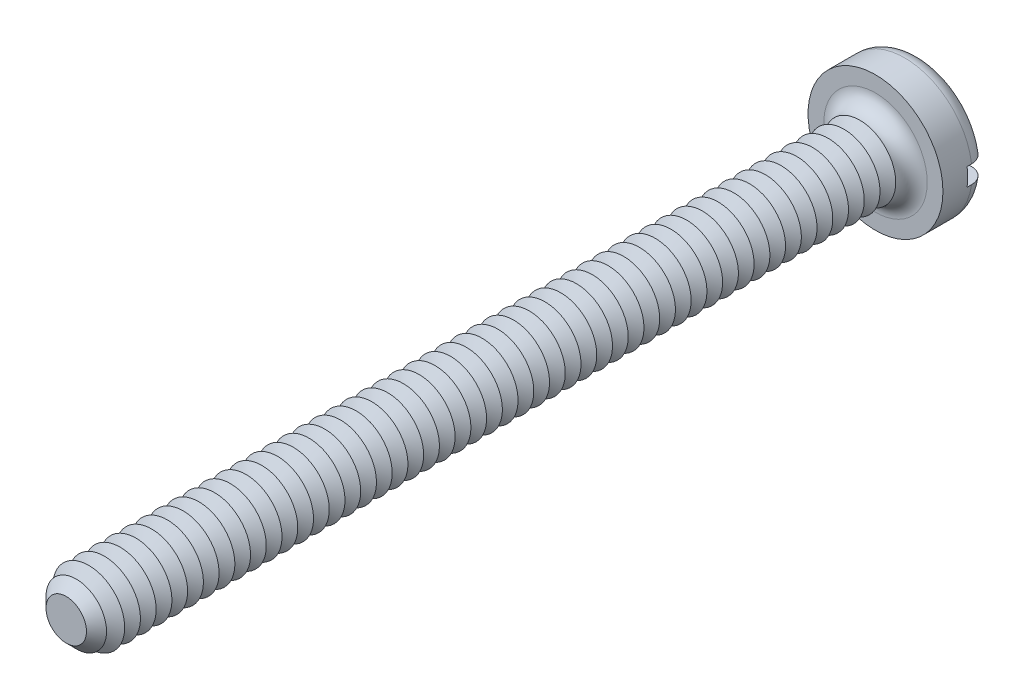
ISO-10303-21;
HEADER;
FILE_DESCRIPTION(('STEP AP214'),'2;1');
FILE_NAME('part.step','',(''),(''),'','','');
FILE_SCHEMA(('AUTOMOTIVE_DESIGN { 1 0 10303 214 1 1 1 1 }'));
ENDSEC;
DATA;
#1=APPLICATION_CONTEXT('core data for automotive mechanical design processes');
#2=APPLICATION_PROTOCOL_DEFINITION('international standard','automotive_design',2000,#1);
#3=PRODUCT_CONTEXT('',#1,'mechanical');
#4=PRODUCT('Part','Part','',(#3));
#5=PRODUCT_RELATED_PRODUCT_CATEGORY('part','',(#4));
#6=PRODUCT_DEFINITION_FORMATION('','',#4);
#7=PRODUCT_DEFINITION_CONTEXT('part definition',#1,'design');
#8=PRODUCT_DEFINITION('design','',#6,#7);
#9=PRODUCT_DEFINITION_SHAPE('','',#8);
#10=(LENGTH_UNIT() NAMED_UNIT(*) SI_UNIT(.MILLI.,.METRE.));
#11=(NAMED_UNIT(*) PLANE_ANGLE_UNIT() SI_UNIT($,.RADIAN.));
#12=(NAMED_UNIT(*) SI_UNIT($,.STERADIAN.) SOLID_ANGLE_UNIT());
#13=UNCERTAINTY_MEASURE_WITH_UNIT(LENGTH_MEASURE(1.E-05),#10,'distance_accuracy_value','');
#14=(GEOMETRIC_REPRESENTATION_CONTEXT(3) GLOBAL_UNCERTAINTY_ASSIGNED_CONTEXT((#13)) GLOBAL_UNIT_ASSIGNED_CONTEXT((#10,
#11,#12)) REPRESENTATION_CONTEXT('',''));
#15=CARTESIAN_POINT('',(0.,0.,0.));
#16=DIRECTION('',(0.,0.,1.));
#17=DIRECTION('',(1.,0.,0.));
#18=AXIS2_PLACEMENT_3D('',#15,#16,#17);
#19=CARTESIAN_POINT('',(0.,0.,-1.));
#20=DIRECTION('',(0.,0.,1.));
#21=DIRECTION('',(1.,0.,0.));
#22=AXIS2_PLACEMENT_3D('',#19,#20,#21);
#23=PLANE('',#22);
#24=CARTESIAN_POINT('',(0.,0.,-1.));
#25=DIRECTION('',(0.,0.,1.));
#26=DIRECTION('',(1.,0.,0.));
#27=AXIS2_PLACEMENT_3D('',#24,#25,#26);
#28=CIRCLE('',#27,1.15);
#29=CARTESIAN_POINT('',(-1.13247516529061,0.2,-1.));
#30=VERTEX_POINT('',#29);
#31=CARTESIAN_POINT('',(1.13247516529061,0.2,-1.));
#32=VERTEX_POINT('',#31);
#33=EDGE_CURVE('E116',#30,#32,#28,.F.);
#34=ORIENTED_EDGE('',*,*,#33,.T.);
#35=DIRECTION('',(1.,0.,0.));
#36=VECTOR('',#35,1.);
#37=CARTESIAN_POINT('',(-1.5,0.2,-1.));
#38=LINE('',#37,#36);
#39=EDGE_CURVE('E111',#30,#32,#38,.T.);
#40=ORIENTED_EDGE('',*,*,#39,.F.);
#41=EDGE_LOOP('',(#34,#40));
#42=FACE_BOUND('',#41,.T.);
#43=ADVANCED_FACE('F39',(#42),#23,.F.);
#44=CARTESIAN_POINT('',(0.,0.,-0.65));
#45=DIRECTION('',(0.,0.,1.));
#46=DIRECTION('',(1.,0.,0.));
#47=AXIS2_PLACEMENT_3D('',#44,#45,#46);
#48=TOROIDAL_SURFACE('',#47,1.15,0.35);
#49=CARTESIAN_POINT('',(-1.38697162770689,0.2,-0.89359719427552));
#50=CARTESIAN_POINT('',(-1.37305556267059,0.2,-0.907805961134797));
#51=CARTESIAN_POINT('',(-1.35791811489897,0.2,-0.9208403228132));
#52=CARTESIAN_POINT('',(-1.32565069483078,0.2,-0.944183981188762));
#53=CARTESIAN_POINT('',(-1.3085180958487,0.2,-0.954489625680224));
#54=CARTESIAN_POINT('',(-1.27278567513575,0.2,-0.972077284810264));
#55=CARTESIAN_POINT('',(-1.25418732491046,0.2,-0.979362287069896));
#56=CARTESIAN_POINT('',(-1.21604452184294,0.2,-0.990735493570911));
#57=CARTESIAN_POINT('',(-1.19650030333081,0.2,-0.994824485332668));
#58=CARTESIAN_POINT('',(-1.15682398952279,0.2,-0.99973845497));
#59=CARTESIAN_POINT('',(-1.1366881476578,0.2,-1.00053316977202));
#60=CARTESIAN_POINT('',(-1.09656272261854,0.2,-0.998770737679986));
#61=CARTESIAN_POINT('',(-1.07657315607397,0.2,-0.996213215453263));
#62=CARTESIAN_POINT('',(-1.03707277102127,0.2,-0.987780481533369));
#63=CARTESIAN_POINT('',(-1.01756977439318,0.2,-0.981868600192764));
#64=CARTESIAN_POINT('',(-0.979825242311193,0.2,-0.966867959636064));
#65=CARTESIAN_POINT('',(-0.961583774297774,0.2,-0.957779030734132));
#66=CARTESIAN_POINT('',(-0.926815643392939,0.2,-0.936628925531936));
#67=CARTESIAN_POINT('',(-0.910295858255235,0.2,-0.924556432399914));
#68=CARTESIAN_POINT('',(-0.879544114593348,0.2,-0.897781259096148));
#69=CARTESIAN_POINT('',(-0.8653120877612,0.2,-0.883078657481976));
#70=CARTESIAN_POINT('',(-0.83972745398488,0.2,-0.851619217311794));
#71=CARTESIAN_POINT('',(-0.8283448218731,0.2,-0.834886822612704));
#72=CARTESIAN_POINT('',(-0.80863848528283,0.2,-0.799707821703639));
#73=CARTESIAN_POINT('',(-0.80031425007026,0.2,-0.781261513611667));
#74=CARTESIAN_POINT('',(-0.787199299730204,0.2,-0.743695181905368));
#75=CARTESIAN_POINT('',(-0.782321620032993,0.2,-0.724605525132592));
#76=CARTESIAN_POINT('',(-0.775930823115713,0.2,-0.685871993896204));
#77=CARTESIAN_POINT('',(-0.774417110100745,0.2,-0.666228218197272));
#78=CARTESIAN_POINT('',(-0.774805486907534,0.2,-0.627456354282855));
#79=CARTESIAN_POINT('',(-0.776625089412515,0.2,-0.608327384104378));
#80=CARTESIAN_POINT('',(-0.783452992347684,0.2,-0.570648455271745));
#81=CARTESIAN_POINT('',(-0.788461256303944,0.2,-0.552098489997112));
#82=CARTESIAN_POINT('',(-0.801489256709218,0.2,-0.516098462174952));
#83=CARTESIAN_POINT('',(-0.809507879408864,0.2,-0.49864799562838));
#84=CARTESIAN_POINT('',(-0.828295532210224,0.2,-0.465297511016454));
#85=CARTESIAN_POINT('',(-0.839064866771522,0.2,-0.449397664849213));
#86=CARTESIAN_POINT('',(-0.863311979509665,0.2,-0.419196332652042));
#87=CARTESIAN_POINT('',(-0.876847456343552,0.2,-0.404941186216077));
#88=CARTESIAN_POINT('',(-0.906064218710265,0.2,-0.378832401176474));
#89=CARTESIAN_POINT('',(-0.921745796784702,0.2,-0.366979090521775));
#90=CARTESIAN_POINT('',(-0.955261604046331,0.2,-0.345690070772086));
#91=CARTESIAN_POINT('',(-0.973141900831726,0.2,-0.336326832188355));
#92=CARTESIAN_POINT('',(-1.01020647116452,0.2,-0.320690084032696));
#93=CARTESIAN_POINT('',(-1.02939085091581,0.2,-0.314416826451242));
#94=CARTESIAN_POINT('',(-1.06878849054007,0.2,-0.305073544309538));
#95=CARTESIAN_POINT('',(-1.0890118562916,0.2,-0.302046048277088));
#96=CARTESIAN_POINT('',(-1.12968032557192,0.2,-0.299436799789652));
#97=CARTESIAN_POINT('',(-1.15012542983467,0.2,-0.299855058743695));
#98=CARTESIAN_POINT('',(-1.1906059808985,0.2,-0.304138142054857));
#99=CARTESIAN_POINT('',(-1.21064224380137,0.2,-0.307995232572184));
#100=CARTESIAN_POINT('',(-1.24976957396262,0.2,-0.319055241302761));
#101=CARTESIAN_POINT('',(-1.26886068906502,0.2,-0.326257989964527));
#102=CARTESIAN_POINT('',(-1.30533597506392,0.2,-0.343725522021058));
#103=CARTESIAN_POINT('',(-1.32273620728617,0.2,-0.353956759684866));
#104=CARTESIAN_POINT('',(-1.35554323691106,0.2,-0.377229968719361));
#105=CARTESIAN_POINT('',(-1.37095016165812,0.2,-0.390271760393));
#106=CARTESIAN_POINT('',(-1.39913145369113,0.2,-0.418621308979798));
#107=CARTESIAN_POINT('',(-1.41193602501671,0.2,-0.43389904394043));
#108=CARTESIAN_POINT('',(-1.43476712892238,0.2,-0.46640589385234));
#109=CARTESIAN_POINT('',(-1.44479381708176,0.2,-0.483634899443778));
#110=CARTESIAN_POINT('',(-1.4616814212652,0.2,-0.519367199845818));
#111=CARTESIAN_POINT('',(-1.46857323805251,0.2,-0.537855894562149));
#112=CARTESIAN_POINT('',(-1.4791331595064,0.2,-0.575731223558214));
#113=CARTESIAN_POINT('',(-1.48280152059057,0.2,-0.595117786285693));
#114=CARTESIAN_POINT('',(-1.4867930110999,0.2,-0.634109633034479));
#115=CARTESIAN_POINT('',(-1.48713684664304,0.2,-0.653712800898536));
#116=CARTESIAN_POINT('',(-1.48452244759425,0.2,-0.692702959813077));
#117=CARTESIAN_POINT('',(-1.48156342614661,0.2,-0.712089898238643));
#118=CARTESIAN_POINT('',(-1.47243636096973,0.2,-0.75006822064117));
#119=CARTESIAN_POINT('',(-1.46627182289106,0.2,-0.768660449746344));
#120=CARTESIAN_POINT('',(-1.45092056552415,0.2,-0.804533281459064));
#121=CARTESIAN_POINT('',(-1.44173755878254,0.2,-0.821815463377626));
#122=CARTESIAN_POINT('',(-1.42477940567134,0.2,-0.848152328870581));
#123=CARTESIAN_POINT('',(-1.41786672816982,0.2,-0.857773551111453));
#124=CARTESIAN_POINT('',(-1.40310412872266,0.2,-0.876267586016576));
#125=CARTESIAN_POINT('',(-1.39525421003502,0.2,-0.885140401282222));
#126=CARTESIAN_POINT('',(-1.38697162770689,0.2,-0.89359719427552));
#127=B_SPLINE_CURVE_WITH_KNOTS('',3,(#49,#50,#51,#52,#53,#54,#55,#56,#57,#58,#59,#60,#61,#62,
#63,#64,#65,#66,#67,#68,#69,#70,#71,#72,#73,#74,#75,#76,#77,#78,#79,#80,#81,#82,#83,#84,#85,#86,
#87,#88,#89,#90,#91,#92,#93,#94,#95,#96,#97,#98,#99,#100,#101,#102,#103,#104,#105,#106,#107,
#108,#109,#110,#111,#112,#113,#114,#115,#116,#117,#118,#119,#120,#121,#122,#123,#124,#125,#126),
.UNSPECIFIED.,.T.,.F.,(4,2,2,2,2,2,2,2,2,2,2,2,2,2,2,2,2,2,2,2,2,2,2,2,2,2,2,2,2,2,2,2,2,2,2,2,
2,2,4),(0.,0.0596211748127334,0.119321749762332,0.178963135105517,0.238589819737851,
0.298763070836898,0.358943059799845,0.419793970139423,0.48064813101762,0.541736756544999,
0.602823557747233,0.663236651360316,0.72363925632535,0.782457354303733,0.841265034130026,
0.898637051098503,0.956008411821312,1.01335856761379,1.07071507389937,1.12941939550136,
1.18813172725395,1.24840147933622,1.30867614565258,1.36973127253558,1.43078660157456,
1.49170496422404,1.55262023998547,1.61288453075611,1.67314496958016,1.73266007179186,
1.792171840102,1.85108355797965,1.90999058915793,1.96853049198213,2.02708434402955,
2.08557429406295,2.14399257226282,2.17947810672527,2.21496351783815),.UNSPECIFIED.);
#128=CARTESIAN_POINT('',(-1.48660687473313,0.2,-0.649999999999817));
#129=VERTEX_POINT('',#128);
#130=EDGE_CURVE('E585',#129,#30,#127,.T.);
#131=ORIENTED_EDGE('',*,*,#130,.F.);
#132=CARTESIAN_POINT('',(0.,0.,-0.65));
#133=DIRECTION('',(0.,0.,1.));
#134=DIRECTION('',(1.,0.,0.));
#135=AXIS2_PLACEMENT_3D('',#132,#133,#134);
#136=CIRCLE('',#135,1.5);
#137=CARTESIAN_POINT('',(1.48660687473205,0.2,-0.649999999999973));
#138=VERTEX_POINT('',#137);
#139=EDGE_CURVE('E125',#138,#129,#136,.T.);
#140=ORIENTED_EDGE('',*,*,#139,.F.);
#141=CARTESIAN_POINT('',(0.780520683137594,0.2,-0.713112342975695));
#142=CARTESIAN_POINT('',(0.784146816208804,0.2,-0.73226748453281));
#143=CARTESIAN_POINT('',(0.789425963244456,0.2,-0.751125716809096));
#144=CARTESIAN_POINT('',(0.803106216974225,0.2,-0.78769198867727));
#145=CARTESIAN_POINT('',(0.811511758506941,0.2,-0.805398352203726));
#146=CARTESIAN_POINT('',(0.831144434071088,0.2,-0.839131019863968));
#147=CARTESIAN_POINT('',(0.842366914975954,0.2,-0.855160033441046));
#148=CARTESIAN_POINT('',(0.867288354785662,0.2,-0.88515062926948));
#149=CARTESIAN_POINT('',(0.880986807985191,0.2,-0.899112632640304));
#150=CARTESIAN_POINT('',(0.910770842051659,0.2,-0.924888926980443));
#151=CARTESIAN_POINT('',(0.926899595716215,0.2,-0.936653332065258));
#152=CARTESIAN_POINT('',(0.960871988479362,0.2,-0.957372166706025));
#153=CARTESIAN_POINT('',(0.978715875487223,0.2,-0.966326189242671));
#154=CARTESIAN_POINT('',(1.01600338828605,0.2,-0.981340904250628));
#155=CARTESIAN_POINT('',(1.03547204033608,0.2,-0.987339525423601));
#156=CARTESIAN_POINT('',(1.07513874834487,0.2,-0.995998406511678));
#157=CARTESIAN_POINT('',(1.09533683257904,0.2,-0.998658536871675));
#158=CARTESIAN_POINT('',(1.1359751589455,0.2,-1.0005575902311));
#159=CARTESIAN_POINT('',(1.1564160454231,0.2,-0.99978283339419));
#160=CARTESIAN_POINT('',(1.19687229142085,0.2,-0.994784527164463));
#161=CARTESIAN_POINT('',(1.21688766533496,0.2,-0.990561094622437));
#162=CARTESIAN_POINT('',(1.25575385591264,0.2,-0.978813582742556));
#163=CARTESIAN_POINT('',(1.27461259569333,0.2,-0.971315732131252));
#164=CARTESIAN_POINT('',(1.31078063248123,0.2,-0.953221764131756));
#165=CARTESIAN_POINT('',(1.32809002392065,0.2,-0.942625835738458));
#166=CARTESIAN_POINT('',(1.36044102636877,0.2,-0.918776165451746));
#167=CARTESIAN_POINT('',(1.37550786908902,0.2,-0.905556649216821));
#168=CARTESIAN_POINT('',(1.40317627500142,0.2,-0.876749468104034));
#169=CARTESIAN_POINT('',(1.41577799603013,0.2,-0.861161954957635));
#170=CARTESIAN_POINT('',(1.43800830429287,0.2,-0.828254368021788));
#171=CARTESIAN_POINT('',(1.44766923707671,0.2,-0.810956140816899));
#172=CARTESIAN_POINT('',(1.46392269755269,0.2,-0.774973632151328));
#173=CARTESIAN_POINT('',(1.4705153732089,0.2,-0.756289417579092));
#174=CARTESIAN_POINT('',(1.48039453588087,0.2,-0.718226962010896));
#175=CARTESIAN_POINT('',(1.48370713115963,0.2,-0.69885549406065));
#176=CARTESIAN_POINT('',(1.48701993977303,0.2,-0.659831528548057));
#177=CARTESIAN_POINT('',(1.4870202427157,0.2,-0.640179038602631));
#178=CARTESIAN_POINT('',(1.48371470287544,0.2,-0.6012267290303));
#179=CARTESIAN_POINT('',(1.48042091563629,0.2,-0.581925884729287));
#180=CARTESIAN_POINT('',(1.47064268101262,0.2,-0.544150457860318));
#181=CARTESIAN_POINT('',(1.46415824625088,0.2,-0.525675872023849));
#182=CARTESIAN_POINT('',(1.4481813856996,0.2,-0.490055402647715));
#183=CARTESIAN_POINT('',(1.43868601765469,0.2,-0.472910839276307));
#184=CARTESIAN_POINT('',(1.41696658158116,0.2,-0.440447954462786));
#185=CARTESIAN_POINT('',(1.40474246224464,0.2,-0.425129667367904));
#186=CARTESIAN_POINT('',(1.37784446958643,0.2,-0.39666049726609));
#187=CARTESIAN_POINT('',(1.36315749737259,0.2,-0.383521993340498));
#188=CARTESIAN_POINT('',(1.33180407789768,0.2,-0.359869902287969));
#189=CARTESIAN_POINT('',(1.31513754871,0.2,-0.349356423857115));
#190=CARTESIAN_POINT('',(1.28013085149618,0.2,-0.331143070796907));
#191=CARTESIAN_POINT('',(1.26177629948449,0.2,-0.323470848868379));
#192=CARTESIAN_POINT('',(1.224049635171,0.2,-0.311275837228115));
#193=CARTESIAN_POINT('',(1.20467746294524,0.2,-0.306753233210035));
#194=CARTESIAN_POINT('',(1.1652160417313,0.2,-0.300927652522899));
#195=CARTESIAN_POINT('',(1.14512096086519,0.2,-0.299664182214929));
#196=CARTESIAN_POINT('',(1.10499953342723,0.2,-0.300488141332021));
#197=CARTESIAN_POINT('',(1.08497319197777,0.2,-0.302575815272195));
#198=CARTESIAN_POINT('',(1.04531606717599,0.2,-0.310075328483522));
#199=CARTESIAN_POINT('',(1.0256923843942,0.2,-0.315524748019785));
#200=CARTESIAN_POINT('',(0.987629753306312,0.2,-0.329624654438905));
#201=CARTESIAN_POINT('',(0.96919087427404,0.2,-0.338275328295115));
#202=CARTESIAN_POINT('',(0.933939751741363,0.2,-0.358590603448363));
#203=CARTESIAN_POINT('',(0.917135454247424,0.2,-0.370269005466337));
#204=CARTESIAN_POINT('',(0.88574931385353,0.2,-0.396306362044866));
#205=CARTESIAN_POINT('',(0.87116734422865,0.2,-0.410665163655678));
#206=CARTESIAN_POINT('',(0.844813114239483,0.2,-0.441518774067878));
#207=CARTESIAN_POINT('',(0.833014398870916,0.2,-0.457990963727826));
#208=CARTESIAN_POINT('',(0.812431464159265,0.2,-0.492729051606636));
#209=CARTESIAN_POINT('',(0.803647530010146,0.2,-0.510995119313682));
#210=CARTESIAN_POINT('',(0.789590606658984,0.2,-0.548308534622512));
#211=CARTESIAN_POINT('',(0.784235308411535,0.2,-0.5673249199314));
#212=CARTESIAN_POINT('',(0.7768953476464,0.2,-0.605979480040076));
#213=CARTESIAN_POINT('',(0.774905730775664,0.2,-0.625616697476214));
#214=CARTESIAN_POINT('',(0.774470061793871,0.2,-0.656633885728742));
#215=CARTESIAN_POINT('',(0.7748847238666,0.2,-0.668009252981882));
#216=CARTESIAN_POINT('',(0.776852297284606,0.2,-0.690660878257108));
#217=CARTESIAN_POINT('',(0.77840517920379,0.2,-0.701937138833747));
#218=CARTESIAN_POINT('',(0.780520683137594,0.2,-0.713112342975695));
#219=B_SPLINE_CURVE_WITH_KNOTS('',3,(#141,#142,#143,#144,#145,#146,#147,#148,#149,#150,#151,
#152,#153,#154,#155,#156,#157,#158,#159,#160,#161,#162,#163,#164,#165,#166,#167,#168,#169,#170,
#171,#172,#173,#174,#175,#176,#177,#178,#179,#180,#181,#182,#183,#184,#185,#186,#187,#188,#189,
#190,#191,#192,#193,#194,#195,#196,#197,#198,#199,#200,#201,#202,#203,#204,#205,#206,#207,#208,
#209,#210,#211,#212,#213,#214,#215,#216,#217,#218),.UNSPECIFIED.,.T.,.F.,(4,2,2,2,2,2,2,2,2,2,2,
2,2,2,2,2,2,2,2,2,2,2,2,2,2,2,2,2,2,2,2,2,2,2,2,2,2,2,4),(0.,0.0584431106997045,
0.11696944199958,0.175399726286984,0.233818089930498,0.293433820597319,0.353058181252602,
0.413886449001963,0.474717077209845,0.53579018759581,0.596861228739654,0.65745180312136,
0.718038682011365,0.777881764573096,0.837721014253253,0.896876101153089,0.95602833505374,
1.01470585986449,1.07338179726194,1.13184377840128,1.19030552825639,1.24882458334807,
1.30734473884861,1.36618662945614,1.42503095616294,1.48443380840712,1.54384016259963,
1.60396331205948,1.66409084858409,1.72490303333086,1.78571877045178,1.84681674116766,
1.90791122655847,1.96839922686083,2.02889294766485,2.08787382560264,2.14676780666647,
2.18086468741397,2.21496068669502),.UNSPECIFIED.);
#220=EDGE_CURVE('E587',#32,#138,#219,.T.);
#221=ORIENTED_EDGE('',*,*,#220,.F.);
#222=ORIENTED_EDGE('',*,*,#33,.F.);
#223=EDGE_LOOP('',(#131,#140,#221,#222));
#224=FACE_BOUND('',#223,.T.);
#225=ADVANCED_FACE('F569',(#224),#48,.T.);
#226=CARTESIAN_POINT('',(0.,0.,-1.));
#227=DIRECTION('',(0.,0.,1.));
#228=DIRECTION('',(1.,0.,0.));
#229=AXIS2_PLACEMENT_3D('',#226,#227,#228);
#230=CYLINDRICAL_SURFACE('',#229,1.5);
#231=DIRECTION('',(0.,0.,1.));
#232=VECTOR('',#231,1.);
#233=CARTESIAN_POINT('',(1.48660687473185,0.2,-1.));
#234=LINE('',#233,#232);
#235=CARTESIAN_POINT('',(1.48660687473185,0.2,-0.55));
#236=VERTEX_POINT('',#235);
#237=EDGE_CURVE('E600',#138,#236,#234,.T.);
#238=ORIENTED_EDGE('',*,*,#237,.F.);
#239=ORIENTED_EDGE('',*,*,#139,.T.);
#240=DIRECTION('',(0.,0.,1.));
#241=VECTOR('',#240,1.);
#242=CARTESIAN_POINT('',(-1.48660687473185,0.2,-1.));
#243=LINE('',#242,#241);
#244=CARTESIAN_POINT('',(-1.48660687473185,0.2,-0.55));
#245=VERTEX_POINT('',#244);
#246=EDGE_CURVE('E63',#245,#129,#243,.F.);
#247=ORIENTED_EDGE('',*,*,#246,.F.);
#248=CARTESIAN_POINT('',(0.,0.,-0.55));
#249=DIRECTION('',(0.,0.,-1.));
#250=DIRECTION('',(-1.,0.,0.));
#251=AXIS2_PLACEMENT_3D('',#248,#249,#250);
#252=CIRCLE('',#251,1.5);
#253=CARTESIAN_POINT('',(-1.48660687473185,-0.2,-0.55));
#254=VERTEX_POINT('',#253);
#255=EDGE_CURVE('E43',#245,#254,#252,.F.);
#256=ORIENTED_EDGE('',*,*,#255,.T.);
#257=DIRECTION('',(0.,0.,1.));
#258=VECTOR('',#257,1.);
#259=CARTESIAN_POINT('',(-1.48660687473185,-0.2,-1.));
#260=LINE('',#259,#258);
#261=CARTESIAN_POINT('',(-1.48660687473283,-0.2,-0.650000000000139));
#262=VERTEX_POINT('',#261);
#263=EDGE_CURVE('E598',#262,#254,#260,.T.);
#264=ORIENTED_EDGE('',*,*,#263,.F.);
#265=CARTESIAN_POINT('',(1.48660687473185,-0.2,-0.65));
#266=VERTEX_POINT('',#265);
#267=EDGE_CURVE('E127',#262,#266,#136,.T.);
#268=ORIENTED_EDGE('',*,*,#267,.T.);
#269=DIRECTION('',(0.,0.,1.));
#270=VECTOR('',#269,1.);
#271=CARTESIAN_POINT('',(1.48660687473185,-0.2,-1.));
#272=LINE('',#271,#270);
#273=CARTESIAN_POINT('',(1.48660687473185,-0.2,-0.55));
#274=VERTEX_POINT('',#273);
#275=EDGE_CURVE('E55',#274,#266,#272,.F.);
#276=ORIENTED_EDGE('',*,*,#275,.F.);
#277=EDGE_CURVE('E11',#274,#236,#252,.F.);
#278=ORIENTED_EDGE('',*,*,#277,.T.);
#279=EDGE_LOOP('',(#238,#239,#247,#256,#264,#268,#276,#278));
#280=FACE_BOUND('',#279,.T.);
#281=CARTESIAN_POINT('',(0.,0.,0.));
#282=DIRECTION('',(0.,0.,1.));
#283=DIRECTION('',(1.,0.,0.));
#284=AXIS2_PLACEMENT_3D('',#281,#282,#283);
#285=CIRCLE('',#284,1.5);
#286=CARTESIAN_POINT('',(1.5,0.,0.));
#287=VERTEX_POINT('',#286);
#288=EDGE_CURVE('E603',#287,#287,#285,.T.);
#289=ORIENTED_EDGE('',*,*,#288,.F.);
#290=EDGE_LOOP('',(#289));
#291=FACE_BOUND('',#290,.T.);
#292=ADVANCED_FACE('F565',(#280,#291),#230,.T.);
#293=CARTESIAN_POINT('',(1.13247516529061,-0.2,-1.));
#294=VERTEX_POINT('',#293);
#295=CARTESIAN_POINT('',(-1.13247516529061,-0.2,-1.));
#296=VERTEX_POINT('',#295);
#297=EDGE_CURVE('E109',#294,#296,#28,.F.);
#298=ORIENTED_EDGE('',*,*,#297,.T.);
#299=DIRECTION('',(-1.,0.,0.));
#300=VECTOR('',#299,1.);
#301=CARTESIAN_POINT('',(-1.5,-0.2,-1.));
#302=LINE('',#301,#300);
#303=EDGE_CURVE('E96',#294,#296,#302,.T.);
#304=ORIENTED_EDGE('',*,*,#303,.F.);
#305=EDGE_LOOP('',(#298,#304));
#306=FACE_BOUND('',#305,.T.);
#307=ADVANCED_FACE('F108',(#306),#23,.F.);
#308=CARTESIAN_POINT('',(0.,0.,0.));
#309=DIRECTION('',(0.,0.,1.));
#310=DIRECTION('',(1.,0.,0.));
#311=AXIS2_PLACEMENT_3D('',#308,#309,#310);
#312=PLANE('',#311);
#313=CARTESIAN_POINT('',(0.,0.,0.));
#314=DIRECTION('',(0.,0.,1.));
#315=DIRECTION('',(1.,0.,0.));
#316=AXIS2_PLACEMENT_3D('',#313,#314,#315);
#317=CIRCLE('',#316,1.15);
#318=CARTESIAN_POINT('',(1.15,0.,0.));
#319=VERTEX_POINT('',#318);
#320=EDGE_CURVE('E115',#319,#319,#317,.F.);
#321=ORIENTED_EDGE('',*,*,#320,.T.);
#322=EDGE_LOOP('',(#321));
#323=FACE_BOUND('',#322,.T.);
#324=ORIENTED_EDGE('',*,*,#288,.T.);
#325=EDGE_LOOP('',(#324));
#326=FACE_BOUND('',#325,.T.);
#327=ADVANCED_FACE('F564',(#323,#326),#312,.T.);
#328=CARTESIAN_POINT('',(-1.38697162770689,-0.2,-0.89359719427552));
#329=CARTESIAN_POINT('',(-1.40068341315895,-0.2,-0.87959447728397));
#330=CARTESIAN_POINT('',(-1.41322919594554,-0.2,-0.864431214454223));
#331=CARTESIAN_POINT('',(-1.43561095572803,-0.2,-0.83220389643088));
#332=CARTESIAN_POINT('',(-1.44544396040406,-0.2,-0.815137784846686));
#333=CARTESIAN_POINT('',(-1.46209732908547,-0.2,-0.779595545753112));
#334=CARTESIAN_POINT('',(-1.46891825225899,-0.2,-0.761119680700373));
#335=CARTESIAN_POINT('',(-1.479344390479,-0.2,-0.723286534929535));
#336=CARTESIAN_POINT('',(-1.48295036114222,-0.2,-0.703929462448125));
#337=CARTESIAN_POINT('',(-1.48683413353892,-0.2,-0.6649653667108));
#338=CARTESIAN_POINT('',(-1.48712565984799,-0.2,-0.645359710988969));
#339=CARTESIAN_POINT('',(-1.48440736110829,-0.2,-0.606378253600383));
#340=CARTESIAN_POINT('',(-1.48139747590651,-0.2,-0.587002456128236));
#341=CARTESIAN_POINT('',(-1.47217267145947,-0.2,-0.549061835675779));
#342=CARTESIAN_POINT('',(-1.46596274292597,-0.2,-0.530495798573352));
#343=CARTESIAN_POINT('',(-1.45052327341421,-0.2,-0.494665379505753));
#344=CARTESIAN_POINT('',(-1.44129371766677,-0.2,-0.477401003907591));
#345=CARTESIAN_POINT('',(-1.42005139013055,-0.2,-0.444603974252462));
#346=CARTESIAN_POINT('',(-1.40803014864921,-0.2,-0.429076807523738));
#347=CARTESIAN_POINT('',(-1.38156905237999,-0.2,-0.400242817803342));
#348=CARTESIAN_POINT('',(-1.36712913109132,-0.2,-0.386936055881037));
#349=CARTESIAN_POINT('',(-1.33612890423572,-0.2,-0.362811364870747));
#350=CARTESIAN_POINT('',(-1.31955365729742,-0.2,-0.352012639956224));
#351=CARTESIAN_POINT('',(-1.28484098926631,-0.2,-0.333316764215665));
#352=CARTESIAN_POINT('',(-1.26670348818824,-0.2,-0.325419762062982));
#353=CARTESIAN_POINT('',(-1.22917040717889,-0.2,-0.31265726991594));
#354=CARTESIAN_POINT('',(-1.20976324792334,-0.2,-0.3078258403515));
#355=CARTESIAN_POINT('',(-1.17041685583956,-0.2,-0.30144641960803));
#356=CARTESIAN_POINT('',(-1.15047758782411,-0.2,-0.299898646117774));
#357=CARTESIAN_POINT('',(-1.11037109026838,-0.2,-0.300112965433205));
#358=CARTESIAN_POINT('',(-1.09020407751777,-0.2,-0.301916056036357));
#359=CARTESIAN_POINT('',(-1.05044996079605,-0.2,-0.308849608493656));
#360=CARTESIAN_POINT('',(-1.03086289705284,-0.2,-0.313980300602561));
#361=CARTESIAN_POINT('',(-0.992636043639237,-0.2,-0.327485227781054));
#362=CARTESIAN_POINT('',(-0.974006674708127,-0.2,-0.335888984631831));
#363=CARTESIAN_POINT('',(-0.938423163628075,-0.2,-0.355707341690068));
#364=CARTESIAN_POINT('',(-0.921469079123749,-0.2,-0.367122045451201));
#365=CARTESIAN_POINT('',(-0.889752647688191,-0.2,-0.392642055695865));
#366=CARTESIAN_POINT('',(-0.874987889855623,-0.2,-0.406744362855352));
#367=CARTESIAN_POINT('',(-0.848085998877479,-0.2,-0.437266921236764));
#368=CARTESIAN_POINT('',(-0.835948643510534,-0.2,-0.453686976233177));
#369=CARTESIAN_POINT('',(-0.814894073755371,-0.2,-0.488078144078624));
#370=CARTESIAN_POINT('',(-0.805923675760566,-0.2,-0.506016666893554));
#371=CARTESIAN_POINT('',(-0.791223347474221,-0.2,-0.543175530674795));
#372=CARTESIAN_POINT('',(-0.78549275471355,-0.2,-0.562395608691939));
#373=CARTESIAN_POINT('',(-0.777599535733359,-0.2,-0.600984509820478));
#374=CARTESIAN_POINT('',(-0.775340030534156,-0.2,-0.62033354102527));
#375=CARTESIAN_POINT('',(-0.774164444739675,-0.2,-0.659131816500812));
#376=CARTESIAN_POINT('',(-0.775247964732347,-0.2,-0.678581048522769));
#377=CARTESIAN_POINT('',(-0.78067015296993,-0.2,-0.716679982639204));
#378=CARTESIAN_POINT('',(-0.784953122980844,-0.2,-0.735337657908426));
#379=CARTESIAN_POINT('',(-0.796558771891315,-0.2,-0.771681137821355));
#380=CARTESIAN_POINT('',(-0.803881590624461,-0.2,-0.789366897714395));
#381=CARTESIAN_POINT('',(-0.821417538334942,-0.2,-0.823475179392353));
#382=CARTESIAN_POINT('',(-0.831660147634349,-0.2,-0.839882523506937));
#383=CARTESIAN_POINT('',(-0.854684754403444,-0.2,-0.870805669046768));
#384=CARTESIAN_POINT('',(-0.867467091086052,-0.2,-0.885321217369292));
#385=CARTESIAN_POINT('',(-0.895584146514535,-0.2,-0.912470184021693));
#386=CARTESIAN_POINT('',(-0.910979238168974,-0.2,-0.925041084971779));
#387=CARTESIAN_POINT('',(-0.943622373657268,-0.2,-0.947488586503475));
#388=CARTESIAN_POINT('',(-0.960870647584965,-0.2,-0.957364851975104));
#389=CARTESIAN_POINT('',(-0.997151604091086,-0.2,-0.974359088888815));
#390=CARTESIAN_POINT('',(-1.01621564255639,-0.2,-0.98141019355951));
#391=CARTESIAN_POINT('',(-1.05525219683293,-0.2,-0.992235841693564));
#392=CARTESIAN_POINT('',(-1.07522472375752,-0.2,-0.996010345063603));
#393=CARTESIAN_POINT('',(-1.11565152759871,-0.2,-1.00018247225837));
#394=CARTESIAN_POINT('',(-1.1361080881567,-0.2,-1.00055804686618));
#395=CARTESIAN_POINT('',(-1.17679659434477,-0.2,-0.997846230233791));
#396=CARTESIAN_POINT('',(-1.19702848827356,-0.2,-0.994758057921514));
#397=CARTESIAN_POINT('',(-1.23655375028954,-0.2,-0.985216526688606));
#398=CARTESIAN_POINT('',(-1.25585198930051,-0.2,-0.978783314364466));
#399=CARTESIAN_POINT('',(-1.29305658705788,-0.2,-0.962732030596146));
#400=CARTESIAN_POINT('',(-1.31096467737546,-0.2,-0.953118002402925));
#401=CARTESIAN_POINT('',(-1.33859353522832,-0.2,-0.935076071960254));
#402=CARTESIAN_POINT('',(-1.34889525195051,-0.2,-0.927521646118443));
#403=CARTESIAN_POINT('',(-1.36861998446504,-0.2,-0.911341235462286));
#404=CARTESIAN_POINT('',(-1.37804300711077,-0.2,-0.90271525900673));
#405=CARTESIAN_POINT('',(-1.38697162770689,-0.2,-0.89359719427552));
#406=B_SPLINE_CURVE_WITH_KNOTS('',3,(#328,#329,#330,#331,#332,#333,#334,#335,#336,#337,#338,
#339,#340,#341,#342,#343,#344,#345,#346,#347,#348,#349,#350,#351,#352,#353,#354,#355,#356,#357,
#358,#359,#360,#361,#362,#363,#364,#365,#366,#367,#368,#369,#370,#371,#372,#373,#374,#375,#376,
#377,#378,#379,#380,#381,#382,#383,#384,#385,#386,#387,#388,#389,#390,#391,#392,#393,#394,#395,
#396,#397,#398,#399,#400,#401,#402,#403,#404,#405),.UNSPECIFIED.,.T.,.F.,(4,2,2,2,2,2,2,2,2,2,2,
2,2,2,2,2,2,2,2,2,2,2,2,2,2,2,2,2,2,2,2,2,2,2,2,2,2,2,4),(0.,0.0587484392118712,
0.117560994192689,0.17636262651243,0.235150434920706,0.293694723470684,0.352240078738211,
0.410694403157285,0.46914901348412,0.527783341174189,0.586419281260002,0.645490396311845,
0.704564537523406,0.76428403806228,0.824007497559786,0.884466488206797,0.944929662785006,
1.00595131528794,1.06697506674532,1.12793111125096,1.18888199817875,1.2487542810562,
1.30861431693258,1.36677117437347,1.4249210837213,1.48208160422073,1.53924475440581,
1.59700685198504,1.65477666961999,1.71413044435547,1.77349159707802,1.83418476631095,
1.89487867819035,1.95596603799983,2.01706717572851,2.07780450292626,2.13846491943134,
2.17672008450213,2.21497495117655),.UNSPECIFIED.);
#407=EDGE_CURVE('E103',#296,#262,#406,.T.);
#408=ORIENTED_EDGE('',*,*,#407,.F.);
#409=ORIENTED_EDGE('',*,*,#297,.F.);
#410=CARTESIAN_POINT('',(0.780520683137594,-0.2,-0.713112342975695));
#411=CARTESIAN_POINT('',(0.776967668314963,-0.2,-0.694332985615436));
#412=CARTESIAN_POINT('',(0.774997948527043,-0.2,-0.675240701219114));
#413=CARTESIAN_POINT('',(0.774305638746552,-0.2,-0.636983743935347));
#414=CARTESIAN_POINT('',(0.775586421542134,-0.2,-0.617819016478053));
#415=CARTESIAN_POINT('',(0.781350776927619,-0.2,-0.579992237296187));
#416=CARTESIAN_POINT('',(0.78583187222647,-0.2,-0.56132980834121));
#417=CARTESIAN_POINT('',(0.797836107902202,-0.2,-0.525016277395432));
#418=CARTESIAN_POINT('',(0.805358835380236,-0.2,-0.507365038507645));
#419=CARTESIAN_POINT('',(0.823276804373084,-0.2,-0.47338978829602));
#420=CARTESIAN_POINT('',(0.833696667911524,-0.2,-0.457078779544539));
#421=CARTESIAN_POINT('',(0.857057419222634,-0.2,-0.426375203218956));
#422=CARTESIAN_POINT('',(0.869998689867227,-0.2,-0.411982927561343));
#423=CARTESIAN_POINT('',(0.898418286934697,-0.2,-0.38510575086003));
#424=CARTESIAN_POINT('',(0.913956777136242,-0.2,-0.372684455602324));
#425=CARTESIAN_POINT('',(0.946860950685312,-0.2,-0.350558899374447));
#426=CARTESIAN_POINT('',(0.964226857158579,-0.2,-0.340854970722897));
#427=CARTESIAN_POINT('',(1.00070854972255,-0.2,-0.324232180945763));
#428=CARTESIAN_POINT('',(1.01985442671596,-0.2,-0.317379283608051));
#429=CARTESIAN_POINT('',(1.0590214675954,-0.2,-0.306962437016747));
#430=CARTESIAN_POINT('',(1.07904267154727,-0.2,-0.303398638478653));
#431=CARTESIAN_POINT('',(1.11952320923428,-0.2,-0.299657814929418));
#432=CARTESIAN_POINT('',(1.13998446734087,-0.2,-0.299501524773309));
#433=CARTESIAN_POINT('',(1.1806395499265,-0.2,-0.302650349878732));
#434=CARTESIAN_POINT('',(1.20083338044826,-0.2,-0.305955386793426));
#435=CARTESIAN_POINT('',(1.24023260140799,-0.2,-0.315918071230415));
#436=CARTESIAN_POINT('',(1.25944372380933,-0.2,-0.322553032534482));
#437=CARTESIAN_POINT('',(1.29645854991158,-0.2,-0.338992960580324));
#438=CARTESIAN_POINT('',(1.31426233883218,-0.2,-0.348797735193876));
#439=CARTESIAN_POINT('',(1.34772734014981,-0.2,-0.371172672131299));
#440=CARTESIAN_POINT('',(1.36341179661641,-0.2,-0.383708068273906));
#441=CARTESIAN_POINT('',(1.39242189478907,-0.2,-0.41126267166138));
#442=CARTESIAN_POINT('',(1.40574768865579,-0.2,-0.426281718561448));
#443=CARTESIAN_POINT('',(1.42949833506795,-0.2,-0.458186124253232));
#444=CARTESIAN_POINT('',(1.43995542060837,-0.2,-0.475047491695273));
#445=CARTESIAN_POINT('',(1.45786189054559,-0.2,-0.510298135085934));
#446=CARTESIAN_POINT('',(1.46531142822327,-0.2,-0.528687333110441));
#447=CARTESIAN_POINT('',(1.47692889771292,-0.2,-0.566301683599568));
#448=CARTESIAN_POINT('',(1.48112438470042,-0.2,-0.585518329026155));
#449=CARTESIAN_POINT('',(1.48621428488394,-0.2,-0.624383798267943));
#450=CARTESIAN_POINT('',(1.48710879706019,-0.2,-0.644032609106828));
#451=CARTESIAN_POINT('',(1.48557356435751,-0.2,-0.683115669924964));
#452=CARTESIAN_POINT('',(1.48315796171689,-0.2,-0.702550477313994));
#453=CARTESIAN_POINT('',(1.47509909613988,-0.2,-0.740738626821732));
#454=CARTESIAN_POINT('',(1.46945585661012,-0.2,-0.759491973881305));
#455=CARTESIAN_POINT('',(1.45510530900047,-0.2,-0.79579446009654));
#456=CARTESIAN_POINT('',(1.44639690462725,-0.2,-0.813343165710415));
#457=CARTESIAN_POINT('',(1.42617120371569,-0.2,-0.846738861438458));
#458=CARTESIAN_POINT('',(1.41465386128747,-0.2,-0.862585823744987));
#459=CARTESIAN_POINT('',(1.3890808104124,-0.2,-0.892214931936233));
#460=CARTESIAN_POINT('',(1.37501291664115,-0.2,-0.90598655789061));
#461=CARTESIAN_POINT('',(1.34478283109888,-0.2,-0.930997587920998));
#462=CARTESIAN_POINT('',(1.32862056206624,-0.2,-0.942236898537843));
#463=CARTESIAN_POINT('',(1.29450693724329,-0.2,-0.96197581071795));
#464=CARTESIAN_POINT('',(1.27654077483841,-0.2,-0.970449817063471));
#465=CARTESIAN_POINT('',(1.23945233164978,-0.2,-0.984300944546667));
#466=CARTESIAN_POINT('',(1.2203299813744,-0.2,-0.989677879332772));
#467=CARTESIAN_POINT('',(1.18123021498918,-0.2,-0.997250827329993));
#468=CARTESIAN_POINT('',(1.16124534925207,-0.2,-0.999408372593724));
#469=CARTESIAN_POINT('',(1.12119456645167,-0.2,-1.00037966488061));
#470=CARTESIAN_POINT('',(1.10112864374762,-0.2,-0.999193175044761));
#471=CARTESIAN_POINT('',(1.06123417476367,-0.2,-0.993489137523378));
#472=CARTESIAN_POINT('',(1.0414112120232,-0.2,-0.988932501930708));
#473=CARTESIAN_POINT('',(1.00280276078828,-0.2,-0.976576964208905));
#474=CARTESIAN_POINT('',(0.984017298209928,-0.2,-0.968777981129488));
#475=CARTESIAN_POINT('',(0.947906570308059,-0.2,-0.95009587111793));
#476=CARTESIAN_POINT('',(0.930590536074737,-0.2,-0.939194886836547));
#477=CARTESIAN_POINT('',(0.89804559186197,-0.2,-0.914617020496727));
#478=CARTESIAN_POINT('',(0.882817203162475,-0.2,-0.900939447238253));
#479=CARTESIAN_POINT('',(0.855020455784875,-0.2,-0.871287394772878));
#480=CARTESIAN_POINT('',(0.84243415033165,-0.2,-0.855329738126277));
#481=CARTESIAN_POINT('',(0.820210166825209,-0.2,-0.821497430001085));
#482=CARTESIAN_POINT('',(0.810568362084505,-0.2,-0.803625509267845));
#483=CARTESIAN_POINT('',(0.797588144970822,-0.2,-0.773519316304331));
#484=CARTESIAN_POINT('',(0.793244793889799,-0.2,-0.761708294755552));
#485=CARTESIAN_POINT('',(0.785879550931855,-0.2,-0.737680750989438));
#486=CARTESIAN_POINT('',(0.782857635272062,-0.2,-0.725464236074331));
#487=CARTESIAN_POINT('',(0.780520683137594,-0.2,-0.713112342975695));
#488=B_SPLINE_CURVE_WITH_KNOTS('',3,(#410,#411,#412,#413,#414,#415,#416,#417,#418,#419,#420,
#421,#422,#423,#424,#425,#426,#427,#428,#429,#430,#431,#432,#433,#434,#435,#436,#437,#438,#439,
#440,#441,#442,#443,#444,#445,#446,#447,#448,#449,#450,#451,#452,#453,#454,#455,#456,#457,#458,
#459,#460,#461,#462,#463,#464,#465,#466,#467,#468,#469,#470,#471,#472,#473,#474,#475,#476,#477,
#478,#479,#480,#481,#482,#483,#484,#485,#486,#487),.UNSPECIFIED.,.T.,.F.,(4,2,2,2,2,2,2,2,2,2,2,
2,2,2,2,2,2,2,2,2,2,2,2,2,2,2,2,2,2,2,2,2,2,2,2,2,2,2,4),(0.,0.057291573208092,
0.114642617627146,0.171949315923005,0.229248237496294,0.287049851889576,0.344860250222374,
0.404266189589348,0.463679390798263,0.524399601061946,0.585122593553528,0.646214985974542,
0.707305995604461,0.767986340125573,0.828663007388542,0.888608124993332,0.948549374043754,
1.00778662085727,1.06702084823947,1.12574783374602,1.18447305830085,1.24294816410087,
1.30142284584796,1.35991846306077,1.41841503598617,1.47719881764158,1.5359847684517,
1.59530034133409,1.65461948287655,1.71464189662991,1.77466856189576,1.83540257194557,
1.89613809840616,1.9572305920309,2.01833831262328,2.0790164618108,2.13960917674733,
2.17729268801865,2.21497552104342),.UNSPECIFIED.);
#489=EDGE_CURVE('E92',#266,#294,#488,.T.);
#490=ORIENTED_EDGE('',*,*,#489,.F.);
#491=ORIENTED_EDGE('',*,*,#267,.F.);
#492=EDGE_LOOP('',(#408,#409,#490,#491));
#493=FACE_BOUND('',#492,.T.);
#494=ADVANCED_FACE('F113',(#493),#48,.T.);
#495=CARTESIAN_POINT('',(0.,0.,0.35));
#496=DIRECTION('',(0.,0.,1.));
#497=DIRECTION('',(1.,0.,0.));
#498=AXIS2_PLACEMENT_3D('',#495,#496,#497);
#499=TOROIDAL_SURFACE('',#498,1.15,0.35);
#500=ORIENTED_EDGE('',*,*,#320,.F.);
#501=EDGE_LOOP('',(#500));
#502=FACE_BOUND('',#501,.T.);
#503=CARTESIAN_POINT('',(0.,0.,0.35));
#504=DIRECTION('',(0.,0.,-1.));
#505=DIRECTION('',(-1.,0.,0.));
#506=AXIS2_PLACEMENT_3D('',#503,#504,#505);
#507=CIRCLE('',#506,0.8);
#508=CARTESIAN_POINT('',(-0.8,0.,0.35));
#509=VERTEX_POINT('',#508);
#510=EDGE_CURVE('E608',#509,#509,#507,.T.);
#511=ORIENTED_EDGE('',*,*,#510,.T.);
#512=EDGE_LOOP('',(#511));
#513=FACE_BOUND('',#512,.T.);
#514=ADVANCED_FACE('F557',(#502,#513),#499,.F.);
#515=CARTESIAN_POINT('',(0.,0.,0.524999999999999));
#516=DIRECTION('',(0.,0.,-1.));
#517=DIRECTION('',(-1.,0.,0.));
#518=AXIS2_PLACEMENT_3D('',#515,#516,#517);
#519=CONICAL_SURFACE('',#518,0.496891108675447,1.0471975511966);
#520=ORIENTED_EDGE('',*,*,#510,.F.);
#521=EDGE_LOOP('',(#520));
#522=FACE_BOUND('',#521,.T.);
#523=CARTESIAN_POINT('',(0.,0.,0.524999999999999));
#524=DIRECTION('',(0.,0.,-1.));
#525=DIRECTION('',(-1.,0.,0.));
#526=AXIS2_PLACEMENT_3D('',#523,#524,#525);
#527=CIRCLE('',#526,0.496891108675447);
#528=CARTESIAN_POINT('',(-0.496891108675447,0.,0.524999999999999));
#529=VERTEX_POINT('',#528);
#530=EDGE_CURVE('E614',#529,#529,#527,.T.);
#531=ORIENTED_EDGE('',*,*,#530,.T.);
#532=EDGE_LOOP('',(#531));
#533=FACE_BOUND('',#532,.T.);
#534=ADVANCED_FACE('F553',(#522,#533),#519,.T.);
#535=CARTESIAN_POINT('',(0.,0.,0.7));
#536=DIRECTION('',(0.,0.,1.));
#537=DIRECTION('',(1.,0.,0.));
#538=AXIS2_PLACEMENT_3D('',#535,#536,#537);
#539=CONICAL_SURFACE('',#538,0.8,1.0471975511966);
#540=ORIENTED_EDGE('',*,*,#530,.F.);
#541=EDGE_LOOP('',(#540));
#542=FACE_BOUND('',#541,.T.);
#543=CARTESIAN_POINT('',(0.,0.,0.7));
#544=DIRECTION('',(0.,0.,-1.));
#545=DIRECTION('',(-1.,0.,0.));
#546=AXIS2_PLACEMENT_3D('',#543,#544,#545);
#547=CIRCLE('',#546,0.8);
#548=CARTESIAN_POINT('',(-0.8,0.,0.7));
#549=VERTEX_POINT('',#548);
#550=EDGE_CURVE('E620',#549,#549,#547,.T.);
#551=ORIENTED_EDGE('',*,*,#550,.T.);
#552=EDGE_LOOP('',(#551));
#553=FACE_BOUND('',#552,.T.);
#554=ADVANCED_FACE('F549',(#542,#553),#539,.T.);
#555=CARTESIAN_POINT('',(0.,0.,0.874999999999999));
#556=DIRECTION('',(0.,0.,-1.));
#557=DIRECTION('',(-1.,0.,0.));
#558=AXIS2_PLACEMENT_3D('',#555,#556,#557);
#559=CONICAL_SURFACE('',#558,0.496891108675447,1.0471975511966);
#560=ORIENTED_EDGE('',*,*,#550,.F.);
#561=EDGE_LOOP('',(#560));
#562=FACE_BOUND('',#561,.T.);
#563=CARTESIAN_POINT('',(0.,0.,0.874999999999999));
#564=DIRECTION('',(0.,0.,-1.));
#565=DIRECTION('',(-1.,0.,0.));
#566=AXIS2_PLACEMENT_3D('',#563,#564,#565);
#567=CIRCLE('',#566,0.496891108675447);
#568=CARTESIAN_POINT('',(-0.496891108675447,0.,0.874999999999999));
#569=VERTEX_POINT('',#568);
#570=EDGE_CURVE('E624',#569,#569,#567,.T.);
#571=ORIENTED_EDGE('',*,*,#570,.T.);
#572=EDGE_LOOP('',(#571));
#573=FACE_BOUND('',#572,.T.);
#574=ADVANCED_FACE('F545',(#562,#573),#559,.T.);
#575=CARTESIAN_POINT('',(0.,0.,1.05));
#576=DIRECTION('',(0.,0.,1.));
#577=DIRECTION('',(1.,0.,0.));
#578=AXIS2_PLACEMENT_3D('',#575,#576,#577);
#579=CONICAL_SURFACE('',#578,0.8,1.0471975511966);
#580=ORIENTED_EDGE('',*,*,#570,.F.);
#581=EDGE_LOOP('',(#580));
#582=FACE_BOUND('',#581,.T.);
#583=CARTESIAN_POINT('',(0.,0.,1.05));
#584=DIRECTION('',(0.,0.,-1.));
#585=DIRECTION('',(-1.,0.,0.));
#586=AXIS2_PLACEMENT_3D('',#583,#584,#585);
#587=CIRCLE('',#586,0.8);
#588=CARTESIAN_POINT('',(-0.8,0.,1.05));
#589=VERTEX_POINT('',#588);
#590=EDGE_CURVE('E627',#589,#589,#587,.T.);
#591=ORIENTED_EDGE('',*,*,#590,.T.);
#592=EDGE_LOOP('',(#591));
#593=FACE_BOUND('',#592,.T.);
#594=ADVANCED_FACE('F541',(#582,#593),#579,.T.);
#595=CARTESIAN_POINT('',(0.,0.,1.225));
#596=DIRECTION('',(0.,0.,-1.));
#597=DIRECTION('',(-1.,0.,0.));
#598=AXIS2_PLACEMENT_3D('',#595,#596,#597);
#599=CONICAL_SURFACE('',#598,0.496891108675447,1.0471975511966);
#600=ORIENTED_EDGE('',*,*,#590,.F.);
#601=EDGE_LOOP('',(#600));
#602=FACE_BOUND('',#601,.T.);
#603=CARTESIAN_POINT('',(0.,0.,1.225));
#604=DIRECTION('',(0.,0.,-1.));
#605=DIRECTION('',(-1.,0.,0.));
#606=AXIS2_PLACEMENT_3D('',#603,#604,#605);
#607=CIRCLE('',#606,0.496891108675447);
#608=CARTESIAN_POINT('',(-0.496891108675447,0.,1.225));
#609=VERTEX_POINT('',#608);
#610=EDGE_CURVE('E631',#609,#609,#607,.T.);
#611=ORIENTED_EDGE('',*,*,#610,.T.);
#612=EDGE_LOOP('',(#611));
#613=FACE_BOUND('',#612,.T.);
#614=ADVANCED_FACE('F537',(#602,#613),#599,.T.);
#615=CARTESIAN_POINT('',(0.,0.,1.4));
#616=DIRECTION('',(0.,0.,1.));
#617=DIRECTION('',(1.,0.,0.));
#618=AXIS2_PLACEMENT_3D('',#615,#616,#617);
#619=CONICAL_SURFACE('',#618,0.8,1.0471975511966);
#620=ORIENTED_EDGE('',*,*,#610,.F.);
#621=EDGE_LOOP('',(#620));
#622=FACE_BOUND('',#621,.T.);
#623=CARTESIAN_POINT('',(0.,0.,1.4));
#624=DIRECTION('',(0.,0.,-1.));
#625=DIRECTION('',(-1.,0.,0.));
#626=AXIS2_PLACEMENT_3D('',#623,#624,#625);
#627=CIRCLE('',#626,0.8);
#628=CARTESIAN_POINT('',(-0.8,0.,1.4));
#629=VERTEX_POINT('',#628);
#630=EDGE_CURVE('E635',#629,#629,#627,.T.);
#631=ORIENTED_EDGE('',*,*,#630,.T.);
#632=EDGE_LOOP('',(#631));
#633=FACE_BOUND('',#632,.T.);
#634=ADVANCED_FACE('F533',(#622,#633),#619,.T.);
#635=CARTESIAN_POINT('',(0.,0.,1.575));
#636=DIRECTION('',(0.,0.,-1.));
#637=DIRECTION('',(-1.,0.,0.));
#638=AXIS2_PLACEMENT_3D('',#635,#636,#637);
#639=CONICAL_SURFACE('',#638,0.496891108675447,1.0471975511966);
#640=ORIENTED_EDGE('',*,*,#630,.F.);
#641=EDGE_LOOP('',(#640));
#642=FACE_BOUND('',#641,.T.);
#643=CARTESIAN_POINT('',(0.,0.,1.575));
#644=DIRECTION('',(0.,0.,-1.));
#645=DIRECTION('',(-1.,0.,0.));
#646=AXIS2_PLACEMENT_3D('',#643,#644,#645);
#647=CIRCLE('',#646,0.496891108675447);
#648=CARTESIAN_POINT('',(-0.496891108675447,0.,1.575));
#649=VERTEX_POINT('',#648);
#650=EDGE_CURVE('E639',#649,#649,#647,.T.);
#651=ORIENTED_EDGE('',*,*,#650,.T.);
#652=EDGE_LOOP('',(#651));
#653=FACE_BOUND('',#652,.T.);
#654=ADVANCED_FACE('F529',(#642,#653),#639,.T.);
#655=CARTESIAN_POINT('',(0.,0.,1.75));
#656=DIRECTION('',(0.,0.,1.));
#657=DIRECTION('',(1.,0.,0.));
#658=AXIS2_PLACEMENT_3D('',#655,#656,#657);
#659=CONICAL_SURFACE('',#658,0.8,1.0471975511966);
#660=ORIENTED_EDGE('',*,*,#650,.F.);
#661=EDGE_LOOP('',(#660));
#662=FACE_BOUND('',#661,.T.);
#663=CARTESIAN_POINT('',(0.,0.,1.75));
#664=DIRECTION('',(0.,0.,-1.));
#665=DIRECTION('',(-1.,0.,0.));
#666=AXIS2_PLACEMENT_3D('',#663,#664,#665);
#667=CIRCLE('',#666,0.8);
#668=CARTESIAN_POINT('',(-0.8,0.,1.75));
#669=VERTEX_POINT('',#668);
#670=EDGE_CURVE('E643',#669,#669,#667,.T.);
#671=ORIENTED_EDGE('',*,*,#670,.T.);
#672=EDGE_LOOP('',(#671));
#673=FACE_BOUND('',#672,.T.);
#674=ADVANCED_FACE('F525',(#662,#673),#659,.T.);
#675=CARTESIAN_POINT('',(0.,0.,1.925));
#676=DIRECTION('',(0.,0.,-1.));
#677=DIRECTION('',(-1.,0.,0.));
#678=AXIS2_PLACEMENT_3D('',#675,#676,#677);
#679=CONICAL_SURFACE('',#678,0.496891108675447,1.0471975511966);
#680=ORIENTED_EDGE('',*,*,#670,.F.);
#681=EDGE_LOOP('',(#680));
#682=FACE_BOUND('',#681,.T.);
#683=CARTESIAN_POINT('',(0.,0.,1.925));
#684=DIRECTION('',(0.,0.,-1.));
#685=DIRECTION('',(-1.,0.,0.));
#686=AXIS2_PLACEMENT_3D('',#683,#684,#685);
#687=CIRCLE('',#686,0.496891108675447);
#688=CARTESIAN_POINT('',(-0.496891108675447,0.,1.925));
#689=VERTEX_POINT('',#688);
#690=EDGE_CURVE('E647',#689,#689,#687,.T.);
#691=ORIENTED_EDGE('',*,*,#690,.T.);
#692=EDGE_LOOP('',(#691));
#693=FACE_BOUND('',#692,.T.);
#694=ADVANCED_FACE('F521',(#682,#693),#679,.T.);
#695=CARTESIAN_POINT('',(0.,0.,2.1));
#696=DIRECTION('',(0.,0.,1.));
#697=DIRECTION('',(1.,0.,0.));
#698=AXIS2_PLACEMENT_3D('',#695,#696,#697);
#699=CONICAL_SURFACE('',#698,0.8,1.0471975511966);
#700=ORIENTED_EDGE('',*,*,#690,.F.);
#701=EDGE_LOOP('',(#700));
#702=FACE_BOUND('',#701,.T.);
#703=CARTESIAN_POINT('',(0.,0.,2.1));
#704=DIRECTION('',(0.,0.,-1.));
#705=DIRECTION('',(-1.,0.,0.));
#706=AXIS2_PLACEMENT_3D('',#703,#704,#705);
#707=CIRCLE('',#706,0.8);
#708=CARTESIAN_POINT('',(-0.8,0.,2.1));
#709=VERTEX_POINT('',#708);
#710=EDGE_CURVE('E651',#709,#709,#707,.T.);
#711=ORIENTED_EDGE('',*,*,#710,.T.);
#712=EDGE_LOOP('',(#711));
#713=FACE_BOUND('',#712,.T.);
#714=ADVANCED_FACE('F517',(#702,#713),#699,.T.);
#715=CARTESIAN_POINT('',(0.,0.,2.275));
#716=DIRECTION('',(0.,0.,-1.));
#717=DIRECTION('',(-1.,0.,0.));
#718=AXIS2_PLACEMENT_3D('',#715,#716,#717);
#719=CONICAL_SURFACE('',#718,0.496891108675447,1.0471975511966);
#720=ORIENTED_EDGE('',*,*,#710,.F.);
#721=EDGE_LOOP('',(#720));
#722=FACE_BOUND('',#721,.T.);
#723=CARTESIAN_POINT('',(0.,0.,2.275));
#724=DIRECTION('',(0.,0.,-1.));
#725=DIRECTION('',(-1.,0.,0.));
#726=AXIS2_PLACEMENT_3D('',#723,#724,#725);
#727=CIRCLE('',#726,0.496891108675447);
#728=CARTESIAN_POINT('',(-0.496891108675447,0.,2.275));
#729=VERTEX_POINT('',#728);
#730=EDGE_CURVE('E655',#729,#729,#727,.T.);
#731=ORIENTED_EDGE('',*,*,#730,.T.);
#732=EDGE_LOOP('',(#731));
#733=FACE_BOUND('',#732,.T.);
#734=ADVANCED_FACE('F513',(#722,#733),#719,.T.);
#735=CARTESIAN_POINT('',(0.,0.,2.45));
#736=DIRECTION('',(0.,0.,1.));
#737=DIRECTION('',(1.,0.,0.));
#738=AXIS2_PLACEMENT_3D('',#735,#736,#737);
#739=CONICAL_SURFACE('',#738,0.8,1.0471975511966);
#740=ORIENTED_EDGE('',*,*,#730,.F.);
#741=EDGE_LOOP('',(#740));
#742=FACE_BOUND('',#741,.T.);
#743=CARTESIAN_POINT('',(0.,0.,2.45));
#744=DIRECTION('',(0.,0.,-1.));
#745=DIRECTION('',(-1.,0.,0.));
#746=AXIS2_PLACEMENT_3D('',#743,#744,#745);
#747=CIRCLE('',#746,0.8);
#748=CARTESIAN_POINT('',(-0.8,0.,2.45));
#749=VERTEX_POINT('',#748);
#750=EDGE_CURVE('E659',#749,#749,#747,.T.);
#751=ORIENTED_EDGE('',*,*,#750,.T.);
#752=EDGE_LOOP('',(#751));
#753=FACE_BOUND('',#752,.T.);
#754=ADVANCED_FACE('F509',(#742,#753),#739,.T.);
#755=CARTESIAN_POINT('',(0.,0.,2.625));
#756=DIRECTION('',(0.,0.,-1.));
#757=DIRECTION('',(-1.,0.,0.));
#758=AXIS2_PLACEMENT_3D('',#755,#756,#757);
#759=CONICAL_SURFACE('',#758,0.496891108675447,1.0471975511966);
#760=ORIENTED_EDGE('',*,*,#750,.F.);
#761=EDGE_LOOP('',(#760));
#762=FACE_BOUND('',#761,.T.);
#763=CARTESIAN_POINT('',(0.,0.,2.625));
#764=DIRECTION('',(0.,0.,-1.));
#765=DIRECTION('',(-1.,0.,0.));
#766=AXIS2_PLACEMENT_3D('',#763,#764,#765);
#767=CIRCLE('',#766,0.496891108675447);
#768=CARTESIAN_POINT('',(-0.496891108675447,0.,2.625));
#769=VERTEX_POINT('',#768);
#770=EDGE_CURVE('E663',#769,#769,#767,.T.);
#771=ORIENTED_EDGE('',*,*,#770,.T.);
#772=EDGE_LOOP('',(#771));
#773=FACE_BOUND('',#772,.T.);
#774=ADVANCED_FACE('F505',(#762,#773),#759,.T.);
#775=CARTESIAN_POINT('',(0.,0.,2.8));
#776=DIRECTION('',(0.,0.,1.));
#777=DIRECTION('',(1.,0.,0.));
#778=AXIS2_PLACEMENT_3D('',#775,#776,#777);
#779=CONICAL_SURFACE('',#778,0.8,1.0471975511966);
#780=ORIENTED_EDGE('',*,*,#770,.F.);
#781=EDGE_LOOP('',(#780));
#782=FACE_BOUND('',#781,.T.);
#783=CARTESIAN_POINT('',(0.,0.,2.8));
#784=DIRECTION('',(0.,0.,-1.));
#785=DIRECTION('',(-1.,0.,0.));
#786=AXIS2_PLACEMENT_3D('',#783,#784,#785);
#787=CIRCLE('',#786,0.8);
#788=CARTESIAN_POINT('',(-0.8,0.,2.8));
#789=VERTEX_POINT('',#788);
#790=EDGE_CURVE('E667',#789,#789,#787,.T.);
#791=ORIENTED_EDGE('',*,*,#790,.T.);
#792=EDGE_LOOP('',(#791));
#793=FACE_BOUND('',#792,.T.);
#794=ADVANCED_FACE('F501',(#782,#793),#779,.T.);
#795=CARTESIAN_POINT('',(0.,0.,2.975));
#796=DIRECTION('',(0.,0.,-1.));
#797=DIRECTION('',(-1.,0.,0.));
#798=AXIS2_PLACEMENT_3D('',#795,#796,#797);
#799=CONICAL_SURFACE('',#798,0.496891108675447,1.0471975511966);
#800=ORIENTED_EDGE('',*,*,#790,.F.);
#801=EDGE_LOOP('',(#800));
#802=FACE_BOUND('',#801,.T.);
#803=CARTESIAN_POINT('',(0.,0.,2.975));
#804=DIRECTION('',(0.,0.,-1.));
#805=DIRECTION('',(-1.,0.,0.));
#806=AXIS2_PLACEMENT_3D('',#803,#804,#805);
#807=CIRCLE('',#806,0.496891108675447);
#808=CARTESIAN_POINT('',(-0.496891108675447,0.,2.975));
#809=VERTEX_POINT('',#808);
#810=EDGE_CURVE('E671',#809,#809,#807,.T.);
#811=ORIENTED_EDGE('',*,*,#810,.T.);
#812=EDGE_LOOP('',(#811));
#813=FACE_BOUND('',#812,.T.);
#814=ADVANCED_FACE('F497',(#802,#813),#799,.T.);
#815=CARTESIAN_POINT('',(0.,0.,3.15));
#816=DIRECTION('',(0.,0.,1.));
#817=DIRECTION('',(1.,0.,0.));
#818=AXIS2_PLACEMENT_3D('',#815,#816,#817);
#819=CONICAL_SURFACE('',#818,0.8,1.0471975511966);
#820=ORIENTED_EDGE('',*,*,#810,.F.);
#821=EDGE_LOOP('',(#820));
#822=FACE_BOUND('',#821,.T.);
#823=CARTESIAN_POINT('',(0.,0.,3.15));
#824=DIRECTION('',(0.,0.,-1.));
#825=DIRECTION('',(-1.,0.,0.));
#826=AXIS2_PLACEMENT_3D('',#823,#824,#825);
#827=CIRCLE('',#826,0.8);
#828=CARTESIAN_POINT('',(-0.8,0.,3.15));
#829=VERTEX_POINT('',#828);
#830=EDGE_CURVE('E675',#829,#829,#827,.T.);
#831=ORIENTED_EDGE('',*,*,#830,.T.);
#832=EDGE_LOOP('',(#831));
#833=FACE_BOUND('',#832,.T.);
#834=ADVANCED_FACE('F493',(#822,#833),#819,.T.);
#835=CARTESIAN_POINT('',(0.,0.,3.325));
#836=DIRECTION('',(0.,0.,-1.));
#837=DIRECTION('',(-1.,0.,0.));
#838=AXIS2_PLACEMENT_3D('',#835,#836,#837);
#839=CONICAL_SURFACE('',#838,0.496891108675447,1.0471975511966);
#840=ORIENTED_EDGE('',*,*,#830,.F.);
#841=EDGE_LOOP('',(#840));
#842=FACE_BOUND('',#841,.T.);
#843=CARTESIAN_POINT('',(0.,0.,3.325));
#844=DIRECTION('',(0.,0.,-1.));
#845=DIRECTION('',(-1.,0.,0.));
#846=AXIS2_PLACEMENT_3D('',#843,#844,#845);
#847=CIRCLE('',#846,0.496891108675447);
#848=CARTESIAN_POINT('',(-0.496891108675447,0.,3.325));
#849=VERTEX_POINT('',#848);
#850=EDGE_CURVE('E678',#849,#849,#847,.T.);
#851=ORIENTED_EDGE('',*,*,#850,.T.);
#852=EDGE_LOOP('',(#851));
#853=FACE_BOUND('',#852,.T.);
#854=ADVANCED_FACE('F489',(#842,#853),#839,.T.);
#855=CARTESIAN_POINT('',(0.,0.,3.5));
#856=DIRECTION('',(0.,0.,1.));
#857=DIRECTION('',(1.,0.,0.));
#858=AXIS2_PLACEMENT_3D('',#855,#856,#857);
#859=CONICAL_SURFACE('',#858,0.8,1.0471975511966);
#860=ORIENTED_EDGE('',*,*,#850,.F.);
#861=EDGE_LOOP('',(#860));
#862=FACE_BOUND('',#861,.T.);
#863=CARTESIAN_POINT('',(0.,0.,3.5));
#864=DIRECTION('',(0.,0.,-1.));
#865=DIRECTION('',(-1.,0.,0.));
#866=AXIS2_PLACEMENT_3D('',#863,#864,#865);
#867=CIRCLE('',#866,0.8);
#868=CARTESIAN_POINT('',(-0.8,0.,3.5));
#869=VERTEX_POINT('',#868);
#870=EDGE_CURVE('E681',#869,#869,#867,.T.);
#871=ORIENTED_EDGE('',*,*,#870,.T.);
#872=EDGE_LOOP('',(#871));
#873=FACE_BOUND('',#872,.T.);
#874=ADVANCED_FACE('F485',(#862,#873),#859,.T.);
#875=CARTESIAN_POINT('',(0.,0.,3.675));
#876=DIRECTION('',(0.,0.,-1.));
#877=DIRECTION('',(-1.,0.,0.));
#878=AXIS2_PLACEMENT_3D('',#875,#876,#877);
#879=CONICAL_SURFACE('',#878,0.496891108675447,1.0471975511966);
#880=ORIENTED_EDGE('',*,*,#870,.F.);
#881=EDGE_LOOP('',(#880));
#882=FACE_BOUND('',#881,.T.);
#883=CARTESIAN_POINT('',(0.,0.,3.675));
#884=DIRECTION('',(0.,0.,-1.));
#885=DIRECTION('',(-1.,0.,0.));
#886=AXIS2_PLACEMENT_3D('',#883,#884,#885);
#887=CIRCLE('',#886,0.496891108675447);
#888=CARTESIAN_POINT('',(-0.496891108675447,0.,3.675));
#889=VERTEX_POINT('',#888);
#890=EDGE_CURVE('E685',#889,#889,#887,.T.);
#891=ORIENTED_EDGE('',*,*,#890,.T.);
#892=EDGE_LOOP('',(#891));
#893=FACE_BOUND('',#892,.T.);
#894=ADVANCED_FACE('F481',(#882,#893),#879,.T.);
#895=CARTESIAN_POINT('',(0.,0.,3.85));
#896=DIRECTION('',(0.,0.,1.));
#897=DIRECTION('',(1.,0.,0.));
#898=AXIS2_PLACEMENT_3D('',#895,#896,#897);
#899=CONICAL_SURFACE('',#898,0.8,1.0471975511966);
#900=ORIENTED_EDGE('',*,*,#890,.F.);
#901=EDGE_LOOP('',(#900));
#902=FACE_BOUND('',#901,.T.);
#903=CARTESIAN_POINT('',(0.,0.,3.85));
#904=DIRECTION('',(0.,0.,-1.));
#905=DIRECTION('',(-1.,0.,0.));
#906=AXIS2_PLACEMENT_3D('',#903,#904,#905);
#907=CIRCLE('',#906,0.8);
#908=CARTESIAN_POINT('',(-0.8,0.,3.85));
#909=VERTEX_POINT('',#908);
#910=EDGE_CURVE('E689',#909,#909,#907,.T.);
#911=ORIENTED_EDGE('',*,*,#910,.T.);
#912=EDGE_LOOP('',(#911));
#913=FACE_BOUND('',#912,.T.);
#914=ADVANCED_FACE('F477',(#902,#913),#899,.T.);
#915=CARTESIAN_POINT('',(0.,0.,4.025));
#916=DIRECTION('',(0.,0.,-1.));
#917=DIRECTION('',(-1.,0.,0.));
#918=AXIS2_PLACEMENT_3D('',#915,#916,#917);
#919=CONICAL_SURFACE('',#918,0.496891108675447,1.0471975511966);
#920=ORIENTED_EDGE('',*,*,#910,.F.);
#921=EDGE_LOOP('',(#920));
#922=FACE_BOUND('',#921,.T.);
#923=CARTESIAN_POINT('',(0.,0.,4.025));
#924=DIRECTION('',(0.,0.,-1.));
#925=DIRECTION('',(-1.,0.,0.));
#926=AXIS2_PLACEMENT_3D('',#923,#924,#925);
#927=CIRCLE('',#926,0.496891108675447);
#928=CARTESIAN_POINT('',(-0.496891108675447,0.,4.025));
#929=VERTEX_POINT('',#928);
#930=EDGE_CURVE('E693',#929,#929,#927,.T.);
#931=ORIENTED_EDGE('',*,*,#930,.T.);
#932=EDGE_LOOP('',(#931));
#933=FACE_BOUND('',#932,.T.);
#934=ADVANCED_FACE('F473',(#922,#933),#919,.T.);
#935=CARTESIAN_POINT('',(0.,0.,4.2));
#936=DIRECTION('',(0.,0.,1.));
#937=DIRECTION('',(1.,0.,0.));
#938=AXIS2_PLACEMENT_3D('',#935,#936,#937);
#939=CONICAL_SURFACE('',#938,0.8,1.0471975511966);
#940=ORIENTED_EDGE('',*,*,#930,.F.);
#941=EDGE_LOOP('',(#940));
#942=FACE_BOUND('',#941,.T.);
#943=CARTESIAN_POINT('',(0.,0.,4.2));
#944=DIRECTION('',(0.,0.,-1.));
#945=DIRECTION('',(-1.,0.,0.));
#946=AXIS2_PLACEMENT_3D('',#943,#944,#945);
#947=CIRCLE('',#946,0.8);
#948=CARTESIAN_POINT('',(-0.8,0.,4.2));
#949=VERTEX_POINT('',#948);
#950=EDGE_CURVE('E697',#949,#949,#947,.T.);
#951=ORIENTED_EDGE('',*,*,#950,.T.);
#952=EDGE_LOOP('',(#951));
#953=FACE_BOUND('',#952,.T.);
#954=ADVANCED_FACE('F469',(#942,#953),#939,.T.);
#955=CARTESIAN_POINT('',(0.,0.,4.375));
#956=DIRECTION('',(0.,0.,-1.));
#957=DIRECTION('',(-1.,0.,0.));
#958=AXIS2_PLACEMENT_3D('',#955,#956,#957);
#959=CONICAL_SURFACE('',#958,0.496891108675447,1.0471975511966);
#960=ORIENTED_EDGE('',*,*,#950,.F.);
#961=EDGE_LOOP('',(#960));
#962=FACE_BOUND('',#961,.T.);
#963=CARTESIAN_POINT('',(0.,0.,4.375));
#964=DIRECTION('',(0.,0.,-1.));
#965=DIRECTION('',(-1.,0.,0.));
#966=AXIS2_PLACEMENT_3D('',#963,#964,#965);
#967=CIRCLE('',#966,0.496891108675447);
#968=CARTESIAN_POINT('',(-0.496891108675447,0.,4.375));
#969=VERTEX_POINT('',#968);
#970=EDGE_CURVE('E701',#969,#969,#967,.T.);
#971=ORIENTED_EDGE('',*,*,#970,.T.);
#972=EDGE_LOOP('',(#971));
#973=FACE_BOUND('',#972,.T.);
#974=ADVANCED_FACE('F465',(#962,#973),#959,.T.);
#975=CARTESIAN_POINT('',(0.,0.,4.55));
#976=DIRECTION('',(0.,0.,1.));
#977=DIRECTION('',(1.,0.,0.));
#978=AXIS2_PLACEMENT_3D('',#975,#976,#977);
#979=CONICAL_SURFACE('',#978,0.8,1.0471975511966);
#980=ORIENTED_EDGE('',*,*,#970,.F.);
#981=EDGE_LOOP('',(#980));
#982=FACE_BOUND('',#981,.T.);
#983=CARTESIAN_POINT('',(0.,0.,4.55));
#984=DIRECTION('',(0.,0.,-1.));
#985=DIRECTION('',(-1.,0.,0.));
#986=AXIS2_PLACEMENT_3D('',#983,#984,#985);
#987=CIRCLE('',#986,0.8);
#988=CARTESIAN_POINT('',(-0.8,0.,4.55));
#989=VERTEX_POINT('',#988);
#990=EDGE_CURVE('E705',#989,#989,#987,.T.);
#991=ORIENTED_EDGE('',*,*,#990,.T.);
#992=EDGE_LOOP('',(#991));
#993=FACE_BOUND('',#992,.T.);
#994=ADVANCED_FACE('F461',(#982,#993),#979,.T.);
#995=CARTESIAN_POINT('',(0.,0.,4.725));
#996=DIRECTION('',(0.,0.,-1.));
#997=DIRECTION('',(-1.,0.,0.));
#998=AXIS2_PLACEMENT_3D('',#995,#996,#997);
#999=CONICAL_SURFACE('',#998,0.496891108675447,1.0471975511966);
#1000=ORIENTED_EDGE('',*,*,#990,.F.);
#1001=EDGE_LOOP('',(#1000));
#1002=FACE_BOUND('',#1001,.T.);
#1003=CARTESIAN_POINT('',(0.,0.,4.725));
#1004=DIRECTION('',(0.,0.,-1.));
#1005=DIRECTION('',(-1.,0.,0.));
#1006=AXIS2_PLACEMENT_3D('',#1003,#1004,#1005);
#1007=CIRCLE('',#1006,0.496891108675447);
#1008=CARTESIAN_POINT('',(-0.496891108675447,0.,4.725));
#1009=VERTEX_POINT('',#1008);
#1010=EDGE_CURVE('E709',#1009,#1009,#1007,.T.);
#1011=ORIENTED_EDGE('',*,*,#1010,.T.);
#1012=EDGE_LOOP('',(#1011));
#1013=FACE_BOUND('',#1012,.T.);
#1014=ADVANCED_FACE('F457',(#1002,#1013),#999,.T.);
#1015=CARTESIAN_POINT('',(0.,0.,4.9));
#1016=DIRECTION('',(0.,0.,1.));
#1017=DIRECTION('',(1.,0.,0.));
#1018=AXIS2_PLACEMENT_3D('',#1015,#1016,#1017);
#1019=CONICAL_SURFACE('',#1018,0.8,1.0471975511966);
#1020=ORIENTED_EDGE('',*,*,#1010,.F.);
#1021=EDGE_LOOP('',(#1020));
#1022=FACE_BOUND('',#1021,.T.);
#1023=CARTESIAN_POINT('',(0.,0.,4.9));
#1024=DIRECTION('',(0.,0.,-1.));
#1025=DIRECTION('',(-1.,0.,0.));
#1026=AXIS2_PLACEMENT_3D('',#1023,#1024,#1025);
#1027=CIRCLE('',#1026,0.8);
#1028=CARTESIAN_POINT('',(-0.8,0.,4.9));
#1029=VERTEX_POINT('',#1028);
#1030=EDGE_CURVE('E713',#1029,#1029,#1027,.T.);
#1031=ORIENTED_EDGE('',*,*,#1030,.T.);
#1032=EDGE_LOOP('',(#1031));
#1033=FACE_BOUND('',#1032,.T.);
#1034=ADVANCED_FACE('F453',(#1022,#1033),#1019,.T.);
#1035=CARTESIAN_POINT('',(0.,0.,5.075));
#1036=DIRECTION('',(0.,0.,-1.));
#1037=DIRECTION('',(-1.,0.,0.));
#1038=AXIS2_PLACEMENT_3D('',#1035,#1036,#1037);
#1039=CONICAL_SURFACE('',#1038,0.496891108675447,1.0471975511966);
#1040=ORIENTED_EDGE('',*,*,#1030,.F.);
#1041=EDGE_LOOP('',(#1040));
#1042=FACE_BOUND('',#1041,.T.);
#1043=CARTESIAN_POINT('',(0.,0.,5.075));
#1044=DIRECTION('',(0.,0.,-1.));
#1045=DIRECTION('',(-1.,0.,0.));
#1046=AXIS2_PLACEMENT_3D('',#1043,#1044,#1045);
#1047=CIRCLE('',#1046,0.496891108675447);
#1048=CARTESIAN_POINT('',(-0.496891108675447,0.,5.075));
#1049=VERTEX_POINT('',#1048);
#1050=EDGE_CURVE('E717',#1049,#1049,#1047,.T.);
#1051=ORIENTED_EDGE('',*,*,#1050,.T.);
#1052=EDGE_LOOP('',(#1051));
#1053=FACE_BOUND('',#1052,.T.);
#1054=ADVANCED_FACE('F449',(#1042,#1053),#1039,.T.);
#1055=CARTESIAN_POINT('',(0.,0.,5.25));
#1056=DIRECTION('',(0.,0.,1.));
#1057=DIRECTION('',(1.,0.,0.));
#1058=AXIS2_PLACEMENT_3D('',#1055,#1056,#1057);
#1059=CONICAL_SURFACE('',#1058,0.8,1.0471975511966);
#1060=ORIENTED_EDGE('',*,*,#1050,.F.);
#1061=EDGE_LOOP('',(#1060));
#1062=FACE_BOUND('',#1061,.T.);
#1063=CARTESIAN_POINT('',(0.,0.,5.25));
#1064=DIRECTION('',(0.,0.,-1.));
#1065=DIRECTION('',(-1.,0.,0.));
#1066=AXIS2_PLACEMENT_3D('',#1063,#1064,#1065);
#1067=CIRCLE('',#1066,0.8);
#1068=CARTESIAN_POINT('',(-0.8,0.,5.25));
#1069=VERTEX_POINT('',#1068);
#1070=EDGE_CURVE('E721',#1069,#1069,#1067,.T.);
#1071=ORIENTED_EDGE('',*,*,#1070,.T.);
#1072=EDGE_LOOP('',(#1071));
#1073=FACE_BOUND('',#1072,.T.);
#1074=ADVANCED_FACE('F445',(#1062,#1073),#1059,.T.);
#1075=CARTESIAN_POINT('',(0.,0.,5.425));
#1076=DIRECTION('',(0.,0.,-1.));
#1077=DIRECTION('',(-1.,0.,0.));
#1078=AXIS2_PLACEMENT_3D('',#1075,#1076,#1077);
#1079=CONICAL_SURFACE('',#1078,0.496891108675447,1.0471975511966);
#1080=ORIENTED_EDGE('',*,*,#1070,.F.);
#1081=EDGE_LOOP('',(#1080));
#1082=FACE_BOUND('',#1081,.T.);
#1083=CARTESIAN_POINT('',(0.,0.,5.425));
#1084=DIRECTION('',(0.,0.,-1.));
#1085=DIRECTION('',(-1.,0.,0.));
#1086=AXIS2_PLACEMENT_3D('',#1083,#1084,#1085);
#1087=CIRCLE('',#1086,0.496891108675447);
#1088=CARTESIAN_POINT('',(-0.496891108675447,0.,5.425));
#1089=VERTEX_POINT('',#1088);
#1090=EDGE_CURVE('E725',#1089,#1089,#1087,.T.);
#1091=ORIENTED_EDGE('',*,*,#1090,.T.);
#1092=EDGE_LOOP('',(#1091));
#1093=FACE_BOUND('',#1092,.T.);
#1094=ADVANCED_FACE('F441',(#1082,#1093),#1079,.T.);
#1095=CARTESIAN_POINT('',(0.,0.,5.6));
#1096=DIRECTION('',(0.,0.,1.));
#1097=DIRECTION('',(1.,0.,0.));
#1098=AXIS2_PLACEMENT_3D('',#1095,#1096,#1097);
#1099=CONICAL_SURFACE('',#1098,0.8,1.0471975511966);
#1100=ORIENTED_EDGE('',*,*,#1090,.F.);
#1101=EDGE_LOOP('',(#1100));
#1102=FACE_BOUND('',#1101,.T.);
#1103=CARTESIAN_POINT('',(0.,0.,5.6));
#1104=DIRECTION('',(0.,0.,-1.));
#1105=DIRECTION('',(-1.,0.,0.));
#1106=AXIS2_PLACEMENT_3D('',#1103,#1104,#1105);
#1107=CIRCLE('',#1106,0.8);
#1108=CARTESIAN_POINT('',(-0.8,0.,5.6));
#1109=VERTEX_POINT('',#1108);
#1110=EDGE_CURVE('E729',#1109,#1109,#1107,.T.);
#1111=ORIENTED_EDGE('',*,*,#1110,.T.);
#1112=EDGE_LOOP('',(#1111));
#1113=FACE_BOUND('',#1112,.T.);
#1114=ADVANCED_FACE('F437',(#1102,#1113),#1099,.T.);
#1115=CARTESIAN_POINT('',(0.,0.,5.775));
#1116=DIRECTION('',(0.,0.,-1.));
#1117=DIRECTION('',(-1.,0.,0.));
#1118=AXIS2_PLACEMENT_3D('',#1115,#1116,#1117);
#1119=CONICAL_SURFACE('',#1118,0.496891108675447,1.0471975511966);
#1120=ORIENTED_EDGE('',*,*,#1110,.F.);
#1121=EDGE_LOOP('',(#1120));
#1122=FACE_BOUND('',#1121,.T.);
#1123=CARTESIAN_POINT('',(0.,0.,5.775));
#1124=DIRECTION('',(0.,0.,-1.));
#1125=DIRECTION('',(-1.,0.,0.));
#1126=AXIS2_PLACEMENT_3D('',#1123,#1124,#1125);
#1127=CIRCLE('',#1126,0.496891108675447);
#1128=CARTESIAN_POINT('',(-0.496891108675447,0.,5.775));
#1129=VERTEX_POINT('',#1128);
#1130=EDGE_CURVE('E733',#1129,#1129,#1127,.T.);
#1131=ORIENTED_EDGE('',*,*,#1130,.T.);
#1132=EDGE_LOOP('',(#1131));
#1133=FACE_BOUND('',#1132,.T.);
#1134=ADVANCED_FACE('F433',(#1122,#1133),#1119,.T.);
#1135=CARTESIAN_POINT('',(0.,0.,5.95));
#1136=DIRECTION('',(0.,0.,1.));
#1137=DIRECTION('',(1.,0.,0.));
#1138=AXIS2_PLACEMENT_3D('',#1135,#1136,#1137);
#1139=CONICAL_SURFACE('',#1138,0.8,1.0471975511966);
#1140=ORIENTED_EDGE('',*,*,#1130,.F.);
#1141=EDGE_LOOP('',(#1140));
#1142=FACE_BOUND('',#1141,.T.);
#1143=CARTESIAN_POINT('',(0.,0.,5.95));
#1144=DIRECTION('',(0.,0.,-1.));
#1145=DIRECTION('',(-1.,0.,0.));
#1146=AXIS2_PLACEMENT_3D('',#1143,#1144,#1145);
#1147=CIRCLE('',#1146,0.8);
#1148=CARTESIAN_POINT('',(-0.8,0.,5.95));
#1149=VERTEX_POINT('',#1148);
#1150=EDGE_CURVE('E737',#1149,#1149,#1147,.T.);
#1151=ORIENTED_EDGE('',*,*,#1150,.T.);
#1152=EDGE_LOOP('',(#1151));
#1153=FACE_BOUND('',#1152,.T.);
#1154=ADVANCED_FACE('F429',(#1142,#1153),#1139,.T.);
#1155=CARTESIAN_POINT('',(0.,0.,6.125));
#1156=DIRECTION('',(0.,0.,-1.));
#1157=DIRECTION('',(-1.,0.,0.));
#1158=AXIS2_PLACEMENT_3D('',#1155,#1156,#1157);
#1159=CONICAL_SURFACE('',#1158,0.496891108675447,1.0471975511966);
#1160=ORIENTED_EDGE('',*,*,#1150,.F.);
#1161=EDGE_LOOP('',(#1160));
#1162=FACE_BOUND('',#1161,.T.);
#1163=CARTESIAN_POINT('',(0.,0.,6.125));
#1164=DIRECTION('',(0.,0.,-1.));
#1165=DIRECTION('',(-1.,0.,0.));
#1166=AXIS2_PLACEMENT_3D('',#1163,#1164,#1165);
#1167=CIRCLE('',#1166,0.496891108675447);
#1168=CARTESIAN_POINT('',(-0.496891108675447,0.,6.125));
#1169=VERTEX_POINT('',#1168);
#1170=EDGE_CURVE('E741',#1169,#1169,#1167,.T.);
#1171=ORIENTED_EDGE('',*,*,#1170,.T.);
#1172=EDGE_LOOP('',(#1171));
#1173=FACE_BOUND('',#1172,.T.);
#1174=ADVANCED_FACE('F425',(#1162,#1173),#1159,.T.);
#1175=CARTESIAN_POINT('',(0.,0.,6.3));
#1176=DIRECTION('',(0.,0.,1.));
#1177=DIRECTION('',(1.,0.,0.));
#1178=AXIS2_PLACEMENT_3D('',#1175,#1176,#1177);
#1179=CONICAL_SURFACE('',#1178,0.8,1.0471975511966);
#1180=ORIENTED_EDGE('',*,*,#1170,.F.);
#1181=EDGE_LOOP('',(#1180));
#1182=FACE_BOUND('',#1181,.T.);
#1183=CARTESIAN_POINT('',(0.,0.,6.3));
#1184=DIRECTION('',(0.,0.,-1.));
#1185=DIRECTION('',(-1.,0.,0.));
#1186=AXIS2_PLACEMENT_3D('',#1183,#1184,#1185);
#1187=CIRCLE('',#1186,0.8);
#1188=CARTESIAN_POINT('',(-0.8,0.,6.3));
#1189=VERTEX_POINT('',#1188);
#1190=EDGE_CURVE('E745',#1189,#1189,#1187,.T.);
#1191=ORIENTED_EDGE('',*,*,#1190,.T.);
#1192=EDGE_LOOP('',(#1191));
#1193=FACE_BOUND('',#1192,.T.);
#1194=ADVANCED_FACE('F421',(#1182,#1193),#1179,.T.);
#1195=CARTESIAN_POINT('',(0.,0.,6.475));
#1196=DIRECTION('',(0.,0.,-1.));
#1197=DIRECTION('',(-1.,0.,0.));
#1198=AXIS2_PLACEMENT_3D('',#1195,#1196,#1197);
#1199=CONICAL_SURFACE('',#1198,0.496891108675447,1.0471975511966);
#1200=ORIENTED_EDGE('',*,*,#1190,.F.);
#1201=EDGE_LOOP('',(#1200));
#1202=FACE_BOUND('',#1201,.T.);
#1203=CARTESIAN_POINT('',(0.,0.,6.475));
#1204=DIRECTION('',(0.,0.,-1.));
#1205=DIRECTION('',(-1.,0.,0.));
#1206=AXIS2_PLACEMENT_3D('',#1203,#1204,#1205);
#1207=CIRCLE('',#1206,0.496891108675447);
#1208=CARTESIAN_POINT('',(-0.496891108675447,0.,6.475));
#1209=VERTEX_POINT('',#1208);
#1210=EDGE_CURVE('E749',#1209,#1209,#1207,.T.);
#1211=ORIENTED_EDGE('',*,*,#1210,.T.);
#1212=EDGE_LOOP('',(#1211));
#1213=FACE_BOUND('',#1212,.T.);
#1214=ADVANCED_FACE('F417',(#1202,#1213),#1199,.T.);
#1215=CARTESIAN_POINT('',(0.,0.,6.65));
#1216=DIRECTION('',(0.,0.,1.));
#1217=DIRECTION('',(1.,0.,0.));
#1218=AXIS2_PLACEMENT_3D('',#1215,#1216,#1217);
#1219=CONICAL_SURFACE('',#1218,0.8,1.0471975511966);
#1220=ORIENTED_EDGE('',*,*,#1210,.F.);
#1221=EDGE_LOOP('',(#1220));
#1222=FACE_BOUND('',#1221,.T.);
#1223=CARTESIAN_POINT('',(0.,0.,6.65));
#1224=DIRECTION('',(0.,0.,-1.));
#1225=DIRECTION('',(-1.,0.,0.));
#1226=AXIS2_PLACEMENT_3D('',#1223,#1224,#1225);
#1227=CIRCLE('',#1226,0.8);
#1228=CARTESIAN_POINT('',(-0.8,0.,6.65));
#1229=VERTEX_POINT('',#1228);
#1230=EDGE_CURVE('E753',#1229,#1229,#1227,.T.);
#1231=ORIENTED_EDGE('',*,*,#1230,.T.);
#1232=EDGE_LOOP('',(#1231));
#1233=FACE_BOUND('',#1232,.T.);
#1234=ADVANCED_FACE('F413',(#1222,#1233),#1219,.T.);
#1235=CARTESIAN_POINT('',(0.,0.,6.825));
#1236=DIRECTION('',(0.,0.,-1.));
#1237=DIRECTION('',(-1.,0.,0.));
#1238=AXIS2_PLACEMENT_3D('',#1235,#1236,#1237);
#1239=CONICAL_SURFACE('',#1238,0.496891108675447,1.0471975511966);
#1240=ORIENTED_EDGE('',*,*,#1230,.F.);
#1241=EDGE_LOOP('',(#1240));
#1242=FACE_BOUND('',#1241,.T.);
#1243=CARTESIAN_POINT('',(0.,0.,6.825));
#1244=DIRECTION('',(0.,0.,-1.));
#1245=DIRECTION('',(-1.,0.,0.));
#1246=AXIS2_PLACEMENT_3D('',#1243,#1244,#1245);
#1247=CIRCLE('',#1246,0.496891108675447);
#1248=CARTESIAN_POINT('',(-0.496891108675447,0.,6.825));
#1249=VERTEX_POINT('',#1248);
#1250=EDGE_CURVE('E757',#1249,#1249,#1247,.T.);
#1251=ORIENTED_EDGE('',*,*,#1250,.T.);
#1252=EDGE_LOOP('',(#1251));
#1253=FACE_BOUND('',#1252,.T.);
#1254=ADVANCED_FACE('F409',(#1242,#1253),#1239,.T.);
#1255=CARTESIAN_POINT('',(0.,0.,7.));
#1256=DIRECTION('',(0.,0.,1.));
#1257=DIRECTION('',(1.,0.,0.));
#1258=AXIS2_PLACEMENT_3D('',#1255,#1256,#1257);
#1259=CONICAL_SURFACE('',#1258,0.8,1.0471975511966);
#1260=ORIENTED_EDGE('',*,*,#1250,.F.);
#1261=EDGE_LOOP('',(#1260));
#1262=FACE_BOUND('',#1261,.T.);
#1263=CARTESIAN_POINT('',(0.,0.,7.));
#1264=DIRECTION('',(0.,0.,-1.));
#1265=DIRECTION('',(-1.,0.,0.));
#1266=AXIS2_PLACEMENT_3D('',#1263,#1264,#1265);
#1267=CIRCLE('',#1266,0.8);
#1268=CARTESIAN_POINT('',(-0.8,0.,7.));
#1269=VERTEX_POINT('',#1268);
#1270=EDGE_CURVE('E761',#1269,#1269,#1267,.T.);
#1271=ORIENTED_EDGE('',*,*,#1270,.T.);
#1272=EDGE_LOOP('',(#1271));
#1273=FACE_BOUND('',#1272,.T.);
#1274=ADVANCED_FACE('F405',(#1262,#1273),#1259,.T.);
#1275=CARTESIAN_POINT('',(0.,0.,7.175));
#1276=DIRECTION('',(0.,0.,-1.));
#1277=DIRECTION('',(-1.,0.,0.));
#1278=AXIS2_PLACEMENT_3D('',#1275,#1276,#1277);
#1279=CONICAL_SURFACE('',#1278,0.496891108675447,1.0471975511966);
#1280=ORIENTED_EDGE('',*,*,#1270,.F.);
#1281=EDGE_LOOP('',(#1280));
#1282=FACE_BOUND('',#1281,.T.);
#1283=CARTESIAN_POINT('',(0.,0.,7.175));
#1284=DIRECTION('',(0.,0.,-1.));
#1285=DIRECTION('',(-1.,0.,0.));
#1286=AXIS2_PLACEMENT_3D('',#1283,#1284,#1285);
#1287=CIRCLE('',#1286,0.496891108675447);
#1288=CARTESIAN_POINT('',(-0.496891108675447,0.,7.175));
#1289=VERTEX_POINT('',#1288);
#1290=EDGE_CURVE('E765',#1289,#1289,#1287,.T.);
#1291=ORIENTED_EDGE('',*,*,#1290,.T.);
#1292=EDGE_LOOP('',(#1291));
#1293=FACE_BOUND('',#1292,.T.);
#1294=ADVANCED_FACE('F401',(#1282,#1293),#1279,.T.);
#1295=CARTESIAN_POINT('',(0.,0.,7.35));
#1296=DIRECTION('',(0.,0.,1.));
#1297=DIRECTION('',(1.,0.,0.));
#1298=AXIS2_PLACEMENT_3D('',#1295,#1296,#1297);
#1299=CONICAL_SURFACE('',#1298,0.8,1.0471975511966);
#1300=ORIENTED_EDGE('',*,*,#1290,.F.);
#1301=EDGE_LOOP('',(#1300));
#1302=FACE_BOUND('',#1301,.T.);
#1303=CARTESIAN_POINT('',(0.,0.,7.35));
#1304=DIRECTION('',(0.,0.,-1.));
#1305=DIRECTION('',(-1.,0.,0.));
#1306=AXIS2_PLACEMENT_3D('',#1303,#1304,#1305);
#1307=CIRCLE('',#1306,0.8);
#1308=CARTESIAN_POINT('',(-0.8,0.,7.35));
#1309=VERTEX_POINT('',#1308);
#1310=EDGE_CURVE('E769',#1309,#1309,#1307,.T.);
#1311=ORIENTED_EDGE('',*,*,#1310,.T.);
#1312=EDGE_LOOP('',(#1311));
#1313=FACE_BOUND('',#1312,.T.);
#1314=ADVANCED_FACE('F397',(#1302,#1313),#1299,.T.);
#1315=CARTESIAN_POINT('',(0.,0.,7.525));
#1316=DIRECTION('',(0.,0.,-1.));
#1317=DIRECTION('',(-1.,0.,0.));
#1318=AXIS2_PLACEMENT_3D('',#1315,#1316,#1317);
#1319=CONICAL_SURFACE('',#1318,0.496891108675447,1.0471975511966);
#1320=ORIENTED_EDGE('',*,*,#1310,.F.);
#1321=EDGE_LOOP('',(#1320));
#1322=FACE_BOUND('',#1321,.T.);
#1323=CARTESIAN_POINT('',(0.,0.,7.525));
#1324=DIRECTION('',(0.,0.,-1.));
#1325=DIRECTION('',(-1.,0.,0.));
#1326=AXIS2_PLACEMENT_3D('',#1323,#1324,#1325);
#1327=CIRCLE('',#1326,0.496891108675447);
#1328=CARTESIAN_POINT('',(-0.496891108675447,0.,7.525));
#1329=VERTEX_POINT('',#1328);
#1330=EDGE_CURVE('E773',#1329,#1329,#1327,.T.);
#1331=ORIENTED_EDGE('',*,*,#1330,.T.);
#1332=EDGE_LOOP('',(#1331));
#1333=FACE_BOUND('',#1332,.T.);
#1334=ADVANCED_FACE('F393',(#1322,#1333),#1319,.T.);
#1335=CARTESIAN_POINT('',(0.,0.,7.7));
#1336=DIRECTION('',(0.,0.,1.));
#1337=DIRECTION('',(1.,0.,0.));
#1338=AXIS2_PLACEMENT_3D('',#1335,#1336,#1337);
#1339=CONICAL_SURFACE('',#1338,0.8,1.0471975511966);
#1340=ORIENTED_EDGE('',*,*,#1330,.F.);
#1341=EDGE_LOOP('',(#1340));
#1342=FACE_BOUND('',#1341,.T.);
#1343=CARTESIAN_POINT('',(0.,0.,7.7));
#1344=DIRECTION('',(0.,0.,-1.));
#1345=DIRECTION('',(-1.,0.,0.));
#1346=AXIS2_PLACEMENT_3D('',#1343,#1344,#1345);
#1347=CIRCLE('',#1346,0.8);
#1348=CARTESIAN_POINT('',(-0.8,0.,7.7));
#1349=VERTEX_POINT('',#1348);
#1350=EDGE_CURVE('E777',#1349,#1349,#1347,.T.);
#1351=ORIENTED_EDGE('',*,*,#1350,.T.);
#1352=EDGE_LOOP('',(#1351));
#1353=FACE_BOUND('',#1352,.T.);
#1354=ADVANCED_FACE('F389',(#1342,#1353),#1339,.T.);
#1355=CARTESIAN_POINT('',(0.,0.,7.875));
#1356=DIRECTION('',(0.,0.,-1.));
#1357=DIRECTION('',(-1.,0.,0.));
#1358=AXIS2_PLACEMENT_3D('',#1355,#1356,#1357);
#1359=CONICAL_SURFACE('',#1358,0.496891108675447,1.0471975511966);
#1360=ORIENTED_EDGE('',*,*,#1350,.F.);
#1361=EDGE_LOOP('',(#1360));
#1362=FACE_BOUND('',#1361,.T.);
#1363=CARTESIAN_POINT('',(0.,0.,7.875));
#1364=DIRECTION('',(0.,0.,-1.));
#1365=DIRECTION('',(-1.,0.,0.));
#1366=AXIS2_PLACEMENT_3D('',#1363,#1364,#1365);
#1367=CIRCLE('',#1366,0.496891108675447);
#1368=CARTESIAN_POINT('',(-0.496891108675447,0.,7.875));
#1369=VERTEX_POINT('',#1368);
#1370=EDGE_CURVE('E781',#1369,#1369,#1367,.T.);
#1371=ORIENTED_EDGE('',*,*,#1370,.T.);
#1372=EDGE_LOOP('',(#1371));
#1373=FACE_BOUND('',#1372,.T.);
#1374=ADVANCED_FACE('F385',(#1362,#1373),#1359,.T.);
#1375=CARTESIAN_POINT('',(0.,0.,8.05));
#1376=DIRECTION('',(0.,0.,1.));
#1377=DIRECTION('',(1.,0.,0.));
#1378=AXIS2_PLACEMENT_3D('',#1375,#1376,#1377);
#1379=CONICAL_SURFACE('',#1378,0.8,1.0471975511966);
#1380=ORIENTED_EDGE('',*,*,#1370,.F.);
#1381=EDGE_LOOP('',(#1380));
#1382=FACE_BOUND('',#1381,.T.);
#1383=CARTESIAN_POINT('',(0.,0.,8.05));
#1384=DIRECTION('',(0.,0.,-1.));
#1385=DIRECTION('',(-1.,0.,0.));
#1386=AXIS2_PLACEMENT_3D('',#1383,#1384,#1385);
#1387=CIRCLE('',#1386,0.8);
#1388=CARTESIAN_POINT('',(-0.8,0.,8.05));
#1389=VERTEX_POINT('',#1388);
#1390=EDGE_CURVE('E785',#1389,#1389,#1387,.T.);
#1391=ORIENTED_EDGE('',*,*,#1390,.T.);
#1392=EDGE_LOOP('',(#1391));
#1393=FACE_BOUND('',#1392,.T.);
#1394=ADVANCED_FACE('F381',(#1382,#1393),#1379,.T.);
#1395=CARTESIAN_POINT('',(0.,0.,8.225));
#1396=DIRECTION('',(0.,0.,-1.));
#1397=DIRECTION('',(-1.,0.,0.));
#1398=AXIS2_PLACEMENT_3D('',#1395,#1396,#1397);
#1399=CONICAL_SURFACE('',#1398,0.496891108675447,1.0471975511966);
#1400=ORIENTED_EDGE('',*,*,#1390,.F.);
#1401=EDGE_LOOP('',(#1400));
#1402=FACE_BOUND('',#1401,.T.);
#1403=CARTESIAN_POINT('',(0.,0.,8.225));
#1404=DIRECTION('',(0.,0.,-1.));
#1405=DIRECTION('',(-1.,0.,0.));
#1406=AXIS2_PLACEMENT_3D('',#1403,#1404,#1405);
#1407=CIRCLE('',#1406,0.496891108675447);
#1408=CARTESIAN_POINT('',(-0.496891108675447,0.,8.225));
#1409=VERTEX_POINT('',#1408);
#1410=EDGE_CURVE('E789',#1409,#1409,#1407,.T.);
#1411=ORIENTED_EDGE('',*,*,#1410,.T.);
#1412=EDGE_LOOP('',(#1411));
#1413=FACE_BOUND('',#1412,.T.);
#1414=ADVANCED_FACE('F377',(#1402,#1413),#1399,.T.);
#1415=CARTESIAN_POINT('',(0.,0.,8.4));
#1416=DIRECTION('',(0.,0.,1.));
#1417=DIRECTION('',(1.,0.,0.));
#1418=AXIS2_PLACEMENT_3D('',#1415,#1416,#1417);
#1419=CONICAL_SURFACE('',#1418,0.8,1.0471975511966);
#1420=ORIENTED_EDGE('',*,*,#1410,.F.);
#1421=EDGE_LOOP('',(#1420));
#1422=FACE_BOUND('',#1421,.T.);
#1423=CARTESIAN_POINT('',(0.,0.,8.4));
#1424=DIRECTION('',(0.,0.,-1.));
#1425=DIRECTION('',(-1.,0.,0.));
#1426=AXIS2_PLACEMENT_3D('',#1423,#1424,#1425);
#1427=CIRCLE('',#1426,0.8);
#1428=CARTESIAN_POINT('',(-0.8,0.,8.4));
#1429=VERTEX_POINT('',#1428);
#1430=EDGE_CURVE('E793',#1429,#1429,#1427,.T.);
#1431=ORIENTED_EDGE('',*,*,#1430,.T.);
#1432=EDGE_LOOP('',(#1431));
#1433=FACE_BOUND('',#1432,.T.);
#1434=ADVANCED_FACE('F373',(#1422,#1433),#1419,.T.);
#1435=CARTESIAN_POINT('',(0.,0.,8.575));
#1436=DIRECTION('',(0.,0.,-1.));
#1437=DIRECTION('',(-1.,0.,0.));
#1438=AXIS2_PLACEMENT_3D('',#1435,#1436,#1437);
#1439=CONICAL_SURFACE('',#1438,0.496891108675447,1.0471975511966);
#1440=ORIENTED_EDGE('',*,*,#1430,.F.);
#1441=EDGE_LOOP('',(#1440));
#1442=FACE_BOUND('',#1441,.T.);
#1443=CARTESIAN_POINT('',(0.,0.,8.575));
#1444=DIRECTION('',(0.,0.,-1.));
#1445=DIRECTION('',(-1.,0.,0.));
#1446=AXIS2_PLACEMENT_3D('',#1443,#1444,#1445);
#1447=CIRCLE('',#1446,0.496891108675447);
#1448=CARTESIAN_POINT('',(-0.496891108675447,0.,8.575));
#1449=VERTEX_POINT('',#1448);
#1450=EDGE_CURVE('E797',#1449,#1449,#1447,.T.);
#1451=ORIENTED_EDGE('',*,*,#1450,.T.);
#1452=EDGE_LOOP('',(#1451));
#1453=FACE_BOUND('',#1452,.T.);
#1454=ADVANCED_FACE('F369',(#1442,#1453),#1439,.T.);
#1455=CARTESIAN_POINT('',(0.,0.,8.75));
#1456=DIRECTION('',(0.,0.,1.));
#1457=DIRECTION('',(1.,0.,0.));
#1458=AXIS2_PLACEMENT_3D('',#1455,#1456,#1457);
#1459=CONICAL_SURFACE('',#1458,0.8,1.0471975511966);
#1460=ORIENTED_EDGE('',*,*,#1450,.F.);
#1461=EDGE_LOOP('',(#1460));
#1462=FACE_BOUND('',#1461,.T.);
#1463=CARTESIAN_POINT('',(0.,0.,8.75));
#1464=DIRECTION('',(0.,0.,-1.));
#1465=DIRECTION('',(-1.,0.,0.));
#1466=AXIS2_PLACEMENT_3D('',#1463,#1464,#1465);
#1467=CIRCLE('',#1466,0.8);
#1468=CARTESIAN_POINT('',(-0.8,0.,8.75));
#1469=VERTEX_POINT('',#1468);
#1470=EDGE_CURVE('E801',#1469,#1469,#1467,.T.);
#1471=ORIENTED_EDGE('',*,*,#1470,.T.);
#1472=EDGE_LOOP('',(#1471));
#1473=FACE_BOUND('',#1472,.T.);
#1474=ADVANCED_FACE('F365',(#1462,#1473),#1459,.T.);
#1475=CARTESIAN_POINT('',(0.,0.,8.925));
#1476=DIRECTION('',(0.,0.,-1.));
#1477=DIRECTION('',(-1.,0.,0.));
#1478=AXIS2_PLACEMENT_3D('',#1475,#1476,#1477);
#1479=CONICAL_SURFACE('',#1478,0.496891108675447,1.0471975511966);
#1480=ORIENTED_EDGE('',*,*,#1470,.F.);
#1481=EDGE_LOOP('',(#1480));
#1482=FACE_BOUND('',#1481,.T.);
#1483=CARTESIAN_POINT('',(0.,0.,8.925));
#1484=DIRECTION('',(0.,0.,-1.));
#1485=DIRECTION('',(-1.,0.,0.));
#1486=AXIS2_PLACEMENT_3D('',#1483,#1484,#1485);
#1487=CIRCLE('',#1486,0.496891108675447);
#1488=CARTESIAN_POINT('',(-0.496891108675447,0.,8.925));
#1489=VERTEX_POINT('',#1488);
#1490=EDGE_CURVE('E805',#1489,#1489,#1487,.T.);
#1491=ORIENTED_EDGE('',*,*,#1490,.T.);
#1492=EDGE_LOOP('',(#1491));
#1493=FACE_BOUND('',#1492,.T.);
#1494=ADVANCED_FACE('F361',(#1482,#1493),#1479,.T.);
#1495=CARTESIAN_POINT('',(0.,0.,9.1));
#1496=DIRECTION('',(0.,0.,1.));
#1497=DIRECTION('',(1.,0.,0.));
#1498=AXIS2_PLACEMENT_3D('',#1495,#1496,#1497);
#1499=CONICAL_SURFACE('',#1498,0.8,1.0471975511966);
#1500=ORIENTED_EDGE('',*,*,#1490,.F.);
#1501=EDGE_LOOP('',(#1500));
#1502=FACE_BOUND('',#1501,.T.);
#1503=CARTESIAN_POINT('',(0.,0.,9.1));
#1504=DIRECTION('',(0.,0.,-1.));
#1505=DIRECTION('',(-1.,0.,0.));
#1506=AXIS2_PLACEMENT_3D('',#1503,#1504,#1505);
#1507=CIRCLE('',#1506,0.8);
#1508=CARTESIAN_POINT('',(-0.8,0.,9.1));
#1509=VERTEX_POINT('',#1508);
#1510=EDGE_CURVE('E809',#1509,#1509,#1507,.T.);
#1511=ORIENTED_EDGE('',*,*,#1510,.T.);
#1512=EDGE_LOOP('',(#1511));
#1513=FACE_BOUND('',#1512,.T.);
#1514=ADVANCED_FACE('F357',(#1502,#1513),#1499,.T.);
#1515=CARTESIAN_POINT('',(0.,0.,9.275));
#1516=DIRECTION('',(0.,0.,-1.));
#1517=DIRECTION('',(-1.,0.,0.));
#1518=AXIS2_PLACEMENT_3D('',#1515,#1516,#1517);
#1519=CONICAL_SURFACE('',#1518,0.496891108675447,1.0471975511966);
#1520=ORIENTED_EDGE('',*,*,#1510,.F.);
#1521=EDGE_LOOP('',(#1520));
#1522=FACE_BOUND('',#1521,.T.);
#1523=CARTESIAN_POINT('',(0.,0.,9.275));
#1524=DIRECTION('',(0.,0.,-1.));
#1525=DIRECTION('',(-1.,0.,0.));
#1526=AXIS2_PLACEMENT_3D('',#1523,#1524,#1525);
#1527=CIRCLE('',#1526,0.496891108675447);
#1528=CARTESIAN_POINT('',(-0.496891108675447,0.,9.275));
#1529=VERTEX_POINT('',#1528);
#1530=EDGE_CURVE('E813',#1529,#1529,#1527,.T.);
#1531=ORIENTED_EDGE('',*,*,#1530,.T.);
#1532=EDGE_LOOP('',(#1531));
#1533=FACE_BOUND('',#1532,.T.);
#1534=ADVANCED_FACE('F353',(#1522,#1533),#1519,.T.);
#1535=CARTESIAN_POINT('',(0.,0.,9.45));
#1536=DIRECTION('',(0.,0.,1.));
#1537=DIRECTION('',(1.,0.,0.));
#1538=AXIS2_PLACEMENT_3D('',#1535,#1536,#1537);
#1539=CONICAL_SURFACE('',#1538,0.8,1.0471975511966);
#1540=ORIENTED_EDGE('',*,*,#1530,.F.);
#1541=EDGE_LOOP('',(#1540));
#1542=FACE_BOUND('',#1541,.T.);
#1543=CARTESIAN_POINT('',(0.,0.,9.45));
#1544=DIRECTION('',(0.,0.,-1.));
#1545=DIRECTION('',(-1.,0.,0.));
#1546=AXIS2_PLACEMENT_3D('',#1543,#1544,#1545);
#1547=CIRCLE('',#1546,0.8);
#1548=CARTESIAN_POINT('',(-0.8,0.,9.45));
#1549=VERTEX_POINT('',#1548);
#1550=EDGE_CURVE('E817',#1549,#1549,#1547,.T.);
#1551=ORIENTED_EDGE('',*,*,#1550,.T.);
#1552=EDGE_LOOP('',(#1551));
#1553=FACE_BOUND('',#1552,.T.);
#1554=ADVANCED_FACE('F349',(#1542,#1553),#1539,.T.);
#1555=CARTESIAN_POINT('',(0.,0.,9.625));
#1556=DIRECTION('',(0.,0.,-1.));
#1557=DIRECTION('',(-1.,0.,0.));
#1558=AXIS2_PLACEMENT_3D('',#1555,#1556,#1557);
#1559=CONICAL_SURFACE('',#1558,0.496891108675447,1.0471975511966);
#1560=ORIENTED_EDGE('',*,*,#1550,.F.);
#1561=EDGE_LOOP('',(#1560));
#1562=FACE_BOUND('',#1561,.T.);
#1563=CARTESIAN_POINT('',(0.,0.,9.625));
#1564=DIRECTION('',(0.,0.,-1.));
#1565=DIRECTION('',(-1.,0.,0.));
#1566=AXIS2_PLACEMENT_3D('',#1563,#1564,#1565);
#1567=CIRCLE('',#1566,0.496891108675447);
#1568=CARTESIAN_POINT('',(-0.496891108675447,0.,9.625));
#1569=VERTEX_POINT('',#1568);
#1570=EDGE_CURVE('E821',#1569,#1569,#1567,.T.);
#1571=ORIENTED_EDGE('',*,*,#1570,.T.);
#1572=EDGE_LOOP('',(#1571));
#1573=FACE_BOUND('',#1572,.T.);
#1574=ADVANCED_FACE('F345',(#1562,#1573),#1559,.T.);
#1575=CARTESIAN_POINT('',(0.,0.,9.8));
#1576=DIRECTION('',(0.,0.,1.));
#1577=DIRECTION('',(1.,0.,0.));
#1578=AXIS2_PLACEMENT_3D('',#1575,#1576,#1577);
#1579=CONICAL_SURFACE('',#1578,0.8,1.0471975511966);
#1580=ORIENTED_EDGE('',*,*,#1570,.F.);
#1581=EDGE_LOOP('',(#1580));
#1582=FACE_BOUND('',#1581,.T.);
#1583=CARTESIAN_POINT('',(0.,0.,9.8));
#1584=DIRECTION('',(0.,0.,-1.));
#1585=DIRECTION('',(-1.,0.,0.));
#1586=AXIS2_PLACEMENT_3D('',#1583,#1584,#1585);
#1587=CIRCLE('',#1586,0.8);
#1588=CARTESIAN_POINT('',(-0.8,0.,9.8));
#1589=VERTEX_POINT('',#1588);
#1590=EDGE_CURVE('E825',#1589,#1589,#1587,.T.);
#1591=ORIENTED_EDGE('',*,*,#1590,.T.);
#1592=EDGE_LOOP('',(#1591));
#1593=FACE_BOUND('',#1592,.T.);
#1594=ADVANCED_FACE('F341',(#1582,#1593),#1579,.T.);
#1595=CARTESIAN_POINT('',(0.,0.,9.975));
#1596=DIRECTION('',(0.,0.,-1.));
#1597=DIRECTION('',(-1.,0.,0.));
#1598=AXIS2_PLACEMENT_3D('',#1595,#1596,#1597);
#1599=CONICAL_SURFACE('',#1598,0.496891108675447,1.0471975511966);
#1600=ORIENTED_EDGE('',*,*,#1590,.F.);
#1601=EDGE_LOOP('',(#1600));
#1602=FACE_BOUND('',#1601,.T.);
#1603=CARTESIAN_POINT('',(0.,0.,9.975));
#1604=DIRECTION('',(0.,0.,-1.));
#1605=DIRECTION('',(-1.,0.,0.));
#1606=AXIS2_PLACEMENT_3D('',#1603,#1604,#1605);
#1607=CIRCLE('',#1606,0.496891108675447);
#1608=CARTESIAN_POINT('',(-0.496891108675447,0.,9.975));
#1609=VERTEX_POINT('',#1608);
#1610=EDGE_CURVE('E829',#1609,#1609,#1607,.T.);
#1611=ORIENTED_EDGE('',*,*,#1610,.T.);
#1612=EDGE_LOOP('',(#1611));
#1613=FACE_BOUND('',#1612,.T.);
#1614=ADVANCED_FACE('F337',(#1602,#1613),#1599,.T.);
#1615=CARTESIAN_POINT('',(0.,0.,10.15));
#1616=DIRECTION('',(0.,0.,1.));
#1617=DIRECTION('',(1.,0.,0.));
#1618=AXIS2_PLACEMENT_3D('',#1615,#1616,#1617);
#1619=CONICAL_SURFACE('',#1618,0.8,1.0471975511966);
#1620=ORIENTED_EDGE('',*,*,#1610,.F.);
#1621=EDGE_LOOP('',(#1620));
#1622=FACE_BOUND('',#1621,.T.);
#1623=CARTESIAN_POINT('',(0.,0.,10.15));
#1624=DIRECTION('',(0.,0.,-1.));
#1625=DIRECTION('',(-1.,0.,0.));
#1626=AXIS2_PLACEMENT_3D('',#1623,#1624,#1625);
#1627=CIRCLE('',#1626,0.8);
#1628=CARTESIAN_POINT('',(-0.8,0.,10.15));
#1629=VERTEX_POINT('',#1628);
#1630=EDGE_CURVE('E833',#1629,#1629,#1627,.T.);
#1631=ORIENTED_EDGE('',*,*,#1630,.T.);
#1632=EDGE_LOOP('',(#1631));
#1633=FACE_BOUND('',#1632,.T.);
#1634=ADVANCED_FACE('F333',(#1622,#1633),#1619,.T.);
#1635=CARTESIAN_POINT('',(0.,0.,10.325));
#1636=DIRECTION('',(0.,0.,-1.));
#1637=DIRECTION('',(-1.,0.,0.));
#1638=AXIS2_PLACEMENT_3D('',#1635,#1636,#1637);
#1639=CONICAL_SURFACE('',#1638,0.496891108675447,1.0471975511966);
#1640=ORIENTED_EDGE('',*,*,#1630,.F.);
#1641=EDGE_LOOP('',(#1640));
#1642=FACE_BOUND('',#1641,.T.);
#1643=CARTESIAN_POINT('',(0.,0.,10.325));
#1644=DIRECTION('',(0.,0.,-1.));
#1645=DIRECTION('',(-1.,0.,0.));
#1646=AXIS2_PLACEMENT_3D('',#1643,#1644,#1645);
#1647=CIRCLE('',#1646,0.496891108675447);
#1648=CARTESIAN_POINT('',(-0.496891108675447,0.,10.325));
#1649=VERTEX_POINT('',#1648);
#1650=EDGE_CURVE('E837',#1649,#1649,#1647,.T.);
#1651=ORIENTED_EDGE('',*,*,#1650,.T.);
#1652=EDGE_LOOP('',(#1651));
#1653=FACE_BOUND('',#1652,.T.);
#1654=ADVANCED_FACE('F329',(#1642,#1653),#1639,.T.);
#1655=CARTESIAN_POINT('',(0.,0.,10.5));
#1656=DIRECTION('',(0.,0.,1.));
#1657=DIRECTION('',(1.,0.,0.));
#1658=AXIS2_PLACEMENT_3D('',#1655,#1656,#1657);
#1659=CONICAL_SURFACE('',#1658,0.8,1.0471975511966);
#1660=ORIENTED_EDGE('',*,*,#1650,.F.);
#1661=EDGE_LOOP('',(#1660));
#1662=FACE_BOUND('',#1661,.T.);
#1663=CARTESIAN_POINT('',(0.,0.,10.5));
#1664=DIRECTION('',(0.,0.,-1.));
#1665=DIRECTION('',(-1.,0.,0.));
#1666=AXIS2_PLACEMENT_3D('',#1663,#1664,#1665);
#1667=CIRCLE('',#1666,0.8);
#1668=CARTESIAN_POINT('',(-0.8,0.,10.5));
#1669=VERTEX_POINT('',#1668);
#1670=EDGE_CURVE('E841',#1669,#1669,#1667,.T.);
#1671=ORIENTED_EDGE('',*,*,#1670,.T.);
#1672=EDGE_LOOP('',(#1671));
#1673=FACE_BOUND('',#1672,.T.);
#1674=ADVANCED_FACE('F325',(#1662,#1673),#1659,.T.);
#1675=CARTESIAN_POINT('',(0.,0.,10.675));
#1676=DIRECTION('',(0.,0.,-1.));
#1677=DIRECTION('',(-1.,0.,0.));
#1678=AXIS2_PLACEMENT_3D('',#1675,#1676,#1677);
#1679=CONICAL_SURFACE('',#1678,0.496891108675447,1.0471975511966);
#1680=ORIENTED_EDGE('',*,*,#1670,.F.);
#1681=EDGE_LOOP('',(#1680));
#1682=FACE_BOUND('',#1681,.T.);
#1683=CARTESIAN_POINT('',(0.,0.,10.675));
#1684=DIRECTION('',(0.,0.,-1.));
#1685=DIRECTION('',(-1.,0.,0.));
#1686=AXIS2_PLACEMENT_3D('',#1683,#1684,#1685);
#1687=CIRCLE('',#1686,0.496891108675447);
#1688=CARTESIAN_POINT('',(-0.496891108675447,0.,10.675));
#1689=VERTEX_POINT('',#1688);
#1690=EDGE_CURVE('E845',#1689,#1689,#1687,.T.);
#1691=ORIENTED_EDGE('',*,*,#1690,.T.);
#1692=EDGE_LOOP('',(#1691));
#1693=FACE_BOUND('',#1692,.T.);
#1694=ADVANCED_FACE('F321',(#1682,#1693),#1679,.T.);
#1695=CARTESIAN_POINT('',(0.,0.,10.85));
#1696=DIRECTION('',(0.,0.,1.));
#1697=DIRECTION('',(1.,0.,0.));
#1698=AXIS2_PLACEMENT_3D('',#1695,#1696,#1697);
#1699=CONICAL_SURFACE('',#1698,0.8,1.0471975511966);
#1700=ORIENTED_EDGE('',*,*,#1690,.F.);
#1701=EDGE_LOOP('',(#1700));
#1702=FACE_BOUND('',#1701,.T.);
#1703=CARTESIAN_POINT('',(0.,0.,10.85));
#1704=DIRECTION('',(0.,0.,-1.));
#1705=DIRECTION('',(-1.,0.,0.));
#1706=AXIS2_PLACEMENT_3D('',#1703,#1704,#1705);
#1707=CIRCLE('',#1706,0.8);
#1708=CARTESIAN_POINT('',(-0.8,0.,10.85));
#1709=VERTEX_POINT('',#1708);
#1710=EDGE_CURVE('E849',#1709,#1709,#1707,.T.);
#1711=ORIENTED_EDGE('',*,*,#1710,.T.);
#1712=EDGE_LOOP('',(#1711));
#1713=FACE_BOUND('',#1712,.T.);
#1714=ADVANCED_FACE('F317',(#1702,#1713),#1699,.T.);
#1715=CARTESIAN_POINT('',(0.,0.,11.025));
#1716=DIRECTION('',(0.,0.,-1.));
#1717=DIRECTION('',(-1.,0.,0.));
#1718=AXIS2_PLACEMENT_3D('',#1715,#1716,#1717);
#1719=CONICAL_SURFACE('',#1718,0.496891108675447,1.0471975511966);
#1720=ORIENTED_EDGE('',*,*,#1710,.F.);
#1721=EDGE_LOOP('',(#1720));
#1722=FACE_BOUND('',#1721,.T.);
#1723=CARTESIAN_POINT('',(0.,0.,11.025));
#1724=DIRECTION('',(0.,0.,-1.));
#1725=DIRECTION('',(-1.,0.,0.));
#1726=AXIS2_PLACEMENT_3D('',#1723,#1724,#1725);
#1727=CIRCLE('',#1726,0.496891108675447);
#1728=CARTESIAN_POINT('',(-0.496891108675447,0.,11.025));
#1729=VERTEX_POINT('',#1728);
#1730=EDGE_CURVE('E853',#1729,#1729,#1727,.T.);
#1731=ORIENTED_EDGE('',*,*,#1730,.T.);
#1732=EDGE_LOOP('',(#1731));
#1733=FACE_BOUND('',#1732,.T.);
#1734=ADVANCED_FACE('F313',(#1722,#1733),#1719,.T.);
#1735=CARTESIAN_POINT('',(0.,0.,11.2));
#1736=DIRECTION('',(0.,0.,1.));
#1737=DIRECTION('',(1.,0.,0.));
#1738=AXIS2_PLACEMENT_3D('',#1735,#1736,#1737);
#1739=CONICAL_SURFACE('',#1738,0.8,1.0471975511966);
#1740=ORIENTED_EDGE('',*,*,#1730,.F.);
#1741=EDGE_LOOP('',(#1740));
#1742=FACE_BOUND('',#1741,.T.);
#1743=CARTESIAN_POINT('',(0.,0.,11.2));
#1744=DIRECTION('',(0.,0.,-1.));
#1745=DIRECTION('',(-1.,0.,0.));
#1746=AXIS2_PLACEMENT_3D('',#1743,#1744,#1745);
#1747=CIRCLE('',#1746,0.8);
#1748=CARTESIAN_POINT('',(-0.8,0.,11.2));
#1749=VERTEX_POINT('',#1748);
#1750=EDGE_CURVE('E857',#1749,#1749,#1747,.T.);
#1751=ORIENTED_EDGE('',*,*,#1750,.T.);
#1752=EDGE_LOOP('',(#1751));
#1753=FACE_BOUND('',#1752,.T.);
#1754=ADVANCED_FACE('F309',(#1742,#1753),#1739,.T.);
#1755=CARTESIAN_POINT('',(0.,0.,11.375));
#1756=DIRECTION('',(0.,0.,-1.));
#1757=DIRECTION('',(-1.,0.,0.));
#1758=AXIS2_PLACEMENT_3D('',#1755,#1756,#1757);
#1759=CONICAL_SURFACE('',#1758,0.496891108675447,1.0471975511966);
#1760=ORIENTED_EDGE('',*,*,#1750,.F.);
#1761=EDGE_LOOP('',(#1760));
#1762=FACE_BOUND('',#1761,.T.);
#1763=CARTESIAN_POINT('',(0.,0.,11.375));
#1764=DIRECTION('',(0.,0.,-1.));
#1765=DIRECTION('',(-1.,0.,0.));
#1766=AXIS2_PLACEMENT_3D('',#1763,#1764,#1765);
#1767=CIRCLE('',#1766,0.496891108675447);
#1768=CARTESIAN_POINT('',(-0.496891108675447,0.,11.375));
#1769=VERTEX_POINT('',#1768);
#1770=EDGE_CURVE('E861',#1769,#1769,#1767,.T.);
#1771=ORIENTED_EDGE('',*,*,#1770,.T.);
#1772=EDGE_LOOP('',(#1771));
#1773=FACE_BOUND('',#1772,.T.);
#1774=ADVANCED_FACE('F305',(#1762,#1773),#1759,.T.);
#1775=CARTESIAN_POINT('',(0.,0.,11.55));
#1776=DIRECTION('',(0.,0.,1.));
#1777=DIRECTION('',(1.,0.,0.));
#1778=AXIS2_PLACEMENT_3D('',#1775,#1776,#1777);
#1779=CONICAL_SURFACE('',#1778,0.8,1.0471975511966);
#1780=ORIENTED_EDGE('',*,*,#1770,.F.);
#1781=EDGE_LOOP('',(#1780));
#1782=FACE_BOUND('',#1781,.T.);
#1783=CARTESIAN_POINT('',(0.,0.,11.55));
#1784=DIRECTION('',(0.,0.,-1.));
#1785=DIRECTION('',(-1.,0.,0.));
#1786=AXIS2_PLACEMENT_3D('',#1783,#1784,#1785);
#1787=CIRCLE('',#1786,0.8);
#1788=CARTESIAN_POINT('',(-0.8,0.,11.55));
#1789=VERTEX_POINT('',#1788);
#1790=EDGE_CURVE('E865',#1789,#1789,#1787,.T.);
#1791=ORIENTED_EDGE('',*,*,#1790,.T.);
#1792=EDGE_LOOP('',(#1791));
#1793=FACE_BOUND('',#1792,.T.);
#1794=ADVANCED_FACE('F301',(#1782,#1793),#1779,.T.);
#1795=CARTESIAN_POINT('',(0.,0.,11.725));
#1796=DIRECTION('',(0.,0.,-1.));
#1797=DIRECTION('',(-1.,0.,0.));
#1798=AXIS2_PLACEMENT_3D('',#1795,#1796,#1797);
#1799=CONICAL_SURFACE('',#1798,0.496891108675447,1.0471975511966);
#1800=ORIENTED_EDGE('',*,*,#1790,.F.);
#1801=EDGE_LOOP('',(#1800));
#1802=FACE_BOUND('',#1801,.T.);
#1803=CARTESIAN_POINT('',(0.,0.,11.725));
#1804=DIRECTION('',(0.,0.,-1.));
#1805=DIRECTION('',(-1.,0.,0.));
#1806=AXIS2_PLACEMENT_3D('',#1803,#1804,#1805);
#1807=CIRCLE('',#1806,0.496891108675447);
#1808=CARTESIAN_POINT('',(-0.496891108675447,0.,11.725));
#1809=VERTEX_POINT('',#1808);
#1810=EDGE_CURVE('E869',#1809,#1809,#1807,.T.);
#1811=ORIENTED_EDGE('',*,*,#1810,.T.);
#1812=EDGE_LOOP('',(#1811));
#1813=FACE_BOUND('',#1812,.T.);
#1814=ADVANCED_FACE('F297',(#1802,#1813),#1799,.T.);
#1815=CARTESIAN_POINT('',(0.,0.,11.9));
#1816=DIRECTION('',(0.,0.,1.));
#1817=DIRECTION('',(1.,0.,0.));
#1818=AXIS2_PLACEMENT_3D('',#1815,#1816,#1817);
#1819=CONICAL_SURFACE('',#1818,0.8,1.0471975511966);
#1820=ORIENTED_EDGE('',*,*,#1810,.F.);
#1821=EDGE_LOOP('',(#1820));
#1822=FACE_BOUND('',#1821,.T.);
#1823=CARTESIAN_POINT('',(0.,0.,11.9));
#1824=DIRECTION('',(0.,0.,-1.));
#1825=DIRECTION('',(-1.,0.,0.));
#1826=AXIS2_PLACEMENT_3D('',#1823,#1824,#1825);
#1827=CIRCLE('',#1826,0.8);
#1828=CARTESIAN_POINT('',(-0.8,0.,11.9));
#1829=VERTEX_POINT('',#1828);
#1830=EDGE_CURVE('E873',#1829,#1829,#1827,.T.);
#1831=ORIENTED_EDGE('',*,*,#1830,.T.);
#1832=EDGE_LOOP('',(#1831));
#1833=FACE_BOUND('',#1832,.T.);
#1834=ADVANCED_FACE('F293',(#1822,#1833),#1819,.T.);
#1835=CARTESIAN_POINT('',(0.,0.,12.075));
#1836=DIRECTION('',(0.,0.,-1.));
#1837=DIRECTION('',(-1.,0.,0.));
#1838=AXIS2_PLACEMENT_3D('',#1835,#1836,#1837);
#1839=CONICAL_SURFACE('',#1838,0.496891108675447,1.0471975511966);
#1840=ORIENTED_EDGE('',*,*,#1830,.F.);
#1841=EDGE_LOOP('',(#1840));
#1842=FACE_BOUND('',#1841,.T.);
#1843=CARTESIAN_POINT('',(0.,0.,12.075));
#1844=DIRECTION('',(0.,0.,-1.));
#1845=DIRECTION('',(-1.,0.,0.));
#1846=AXIS2_PLACEMENT_3D('',#1843,#1844,#1845);
#1847=CIRCLE('',#1846,0.496891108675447);
#1848=CARTESIAN_POINT('',(-0.496891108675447,0.,12.075));
#1849=VERTEX_POINT('',#1848);
#1850=EDGE_CURVE('E877',#1849,#1849,#1847,.T.);
#1851=ORIENTED_EDGE('',*,*,#1850,.T.);
#1852=EDGE_LOOP('',(#1851));
#1853=FACE_BOUND('',#1852,.T.);
#1854=ADVANCED_FACE('F289',(#1842,#1853),#1839,.T.);
#1855=CARTESIAN_POINT('',(0.,0.,12.25));
#1856=DIRECTION('',(0.,0.,1.));
#1857=DIRECTION('',(1.,0.,0.));
#1858=AXIS2_PLACEMENT_3D('',#1855,#1856,#1857);
#1859=CONICAL_SURFACE('',#1858,0.8,1.0471975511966);
#1860=ORIENTED_EDGE('',*,*,#1850,.F.);
#1861=EDGE_LOOP('',(#1860));
#1862=FACE_BOUND('',#1861,.T.);
#1863=CARTESIAN_POINT('',(0.,0.,12.25));
#1864=DIRECTION('',(0.,0.,-1.));
#1865=DIRECTION('',(-1.,0.,0.));
#1866=AXIS2_PLACEMENT_3D('',#1863,#1864,#1865);
#1867=CIRCLE('',#1866,0.8);
#1868=CARTESIAN_POINT('',(-0.8,0.,12.25));
#1869=VERTEX_POINT('',#1868);
#1870=EDGE_CURVE('E880',#1869,#1869,#1867,.T.);
#1871=ORIENTED_EDGE('',*,*,#1870,.T.);
#1872=EDGE_LOOP('',(#1871));
#1873=FACE_BOUND('',#1872,.T.);
#1874=ADVANCED_FACE('F285',(#1862,#1873),#1859,.T.);
#1875=CARTESIAN_POINT('',(0.,0.,12.425));
#1876=DIRECTION('',(0.,0.,-1.));
#1877=DIRECTION('',(-1.,0.,0.));
#1878=AXIS2_PLACEMENT_3D('',#1875,#1876,#1877);
#1879=CONICAL_SURFACE('',#1878,0.496891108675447,1.0471975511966);
#1880=ORIENTED_EDGE('',*,*,#1870,.F.);
#1881=EDGE_LOOP('',(#1880));
#1882=FACE_BOUND('',#1881,.T.);
#1883=CARTESIAN_POINT('',(0.,0.,12.425));
#1884=DIRECTION('',(0.,0.,-1.));
#1885=DIRECTION('',(-1.,0.,0.));
#1886=AXIS2_PLACEMENT_3D('',#1883,#1884,#1885);
#1887=CIRCLE('',#1886,0.496891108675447);
#1888=CARTESIAN_POINT('',(-0.496891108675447,0.,12.425));
#1889=VERTEX_POINT('',#1888);
#1890=EDGE_CURVE('E884',#1889,#1889,#1887,.T.);
#1891=ORIENTED_EDGE('',*,*,#1890,.T.);
#1892=EDGE_LOOP('',(#1891));
#1893=FACE_BOUND('',#1892,.T.);
#1894=ADVANCED_FACE('F281',(#1882,#1893),#1879,.T.);
#1895=CARTESIAN_POINT('',(0.,0.,12.6));
#1896=DIRECTION('',(0.,0.,1.));
#1897=DIRECTION('',(1.,0.,0.));
#1898=AXIS2_PLACEMENT_3D('',#1895,#1896,#1897);
#1899=CONICAL_SURFACE('',#1898,0.8,1.0471975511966);
#1900=ORIENTED_EDGE('',*,*,#1890,.F.);
#1901=EDGE_LOOP('',(#1900));
#1902=FACE_BOUND('',#1901,.T.);
#1903=CARTESIAN_POINT('',(0.,0.,12.6));
#1904=DIRECTION('',(0.,0.,-1.));
#1905=DIRECTION('',(-1.,0.,0.));
#1906=AXIS2_PLACEMENT_3D('',#1903,#1904,#1905);
#1907=CIRCLE('',#1906,0.8);
#1908=CARTESIAN_POINT('',(-0.8,0.,12.6));
#1909=VERTEX_POINT('',#1908);
#1910=EDGE_CURVE('E888',#1909,#1909,#1907,.T.);
#1911=ORIENTED_EDGE('',*,*,#1910,.T.);
#1912=EDGE_LOOP('',(#1911));
#1913=FACE_BOUND('',#1912,.T.);
#1914=ADVANCED_FACE('F277',(#1902,#1913),#1899,.T.);
#1915=CARTESIAN_POINT('',(0.,0.,12.775));
#1916=DIRECTION('',(0.,0.,-1.));
#1917=DIRECTION('',(-1.,0.,0.));
#1918=AXIS2_PLACEMENT_3D('',#1915,#1916,#1917);
#1919=CONICAL_SURFACE('',#1918,0.496891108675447,1.0471975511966);
#1920=ORIENTED_EDGE('',*,*,#1910,.F.);
#1921=EDGE_LOOP('',(#1920));
#1922=FACE_BOUND('',#1921,.T.);
#1923=CARTESIAN_POINT('',(0.,0.,12.775));
#1924=DIRECTION('',(0.,0.,-1.));
#1925=DIRECTION('',(-1.,0.,0.));
#1926=AXIS2_PLACEMENT_3D('',#1923,#1924,#1925);
#1927=CIRCLE('',#1926,0.496891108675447);
#1928=CARTESIAN_POINT('',(-0.496891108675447,0.,12.775));
#1929=VERTEX_POINT('',#1928);
#1930=EDGE_CURVE('E892',#1929,#1929,#1927,.T.);
#1931=ORIENTED_EDGE('',*,*,#1930,.T.);
#1932=EDGE_LOOP('',(#1931));
#1933=FACE_BOUND('',#1932,.T.);
#1934=ADVANCED_FACE('F273',(#1922,#1933),#1919,.T.);
#1935=CARTESIAN_POINT('',(0.,0.,12.95));
#1936=DIRECTION('',(0.,0.,1.));
#1937=DIRECTION('',(1.,0.,0.));
#1938=AXIS2_PLACEMENT_3D('',#1935,#1936,#1937);
#1939=CONICAL_SURFACE('',#1938,0.8,1.0471975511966);
#1940=ORIENTED_EDGE('',*,*,#1930,.F.);
#1941=EDGE_LOOP('',(#1940));
#1942=FACE_BOUND('',#1941,.T.);
#1943=CARTESIAN_POINT('',(0.,0.,12.95));
#1944=DIRECTION('',(0.,0.,-1.));
#1945=DIRECTION('',(-1.,0.,0.));
#1946=AXIS2_PLACEMENT_3D('',#1943,#1944,#1945);
#1947=CIRCLE('',#1946,0.8);
#1948=CARTESIAN_POINT('',(-0.8,0.,12.95));
#1949=VERTEX_POINT('',#1948);
#1950=EDGE_CURVE('E896',#1949,#1949,#1947,.T.);
#1951=ORIENTED_EDGE('',*,*,#1950,.T.);
#1952=EDGE_LOOP('',(#1951));
#1953=FACE_BOUND('',#1952,.T.);
#1954=ADVANCED_FACE('F269',(#1942,#1953),#1939,.T.);
#1955=CARTESIAN_POINT('',(0.,0.,13.125));
#1956=DIRECTION('',(0.,0.,-1.));
#1957=DIRECTION('',(-1.,0.,0.));
#1958=AXIS2_PLACEMENT_3D('',#1955,#1956,#1957);
#1959=CONICAL_SURFACE('',#1958,0.496891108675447,1.0471975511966);
#1960=ORIENTED_EDGE('',*,*,#1950,.F.);
#1961=EDGE_LOOP('',(#1960));
#1962=FACE_BOUND('',#1961,.T.);
#1963=CARTESIAN_POINT('',(0.,0.,13.125));
#1964=DIRECTION('',(0.,0.,-1.));
#1965=DIRECTION('',(-1.,0.,0.));
#1966=AXIS2_PLACEMENT_3D('',#1963,#1964,#1965);
#1967=CIRCLE('',#1966,0.496891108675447);
#1968=CARTESIAN_POINT('',(-0.496891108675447,0.,13.125));
#1969=VERTEX_POINT('',#1968);
#1970=EDGE_CURVE('E900',#1969,#1969,#1967,.T.);
#1971=ORIENTED_EDGE('',*,*,#1970,.T.);
#1972=EDGE_LOOP('',(#1971));
#1973=FACE_BOUND('',#1972,.T.);
#1974=ADVANCED_FACE('F265',(#1962,#1973),#1959,.T.);
#1975=CARTESIAN_POINT('',(0.,0.,13.3));
#1976=DIRECTION('',(0.,0.,1.));
#1977=DIRECTION('',(1.,0.,0.));
#1978=AXIS2_PLACEMENT_3D('',#1975,#1976,#1977);
#1979=CONICAL_SURFACE('',#1978,0.8,1.0471975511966);
#1980=ORIENTED_EDGE('',*,*,#1970,.F.);
#1981=EDGE_LOOP('',(#1980));
#1982=FACE_BOUND('',#1981,.T.);
#1983=CARTESIAN_POINT('',(0.,0.,13.3));
#1984=DIRECTION('',(0.,0.,-1.));
#1985=DIRECTION('',(-1.,0.,0.));
#1986=AXIS2_PLACEMENT_3D('',#1983,#1984,#1985);
#1987=CIRCLE('',#1986,0.8);
#1988=CARTESIAN_POINT('',(-0.8,0.,13.3));
#1989=VERTEX_POINT('',#1988);
#1990=EDGE_CURVE('E904',#1989,#1989,#1987,.T.);
#1991=ORIENTED_EDGE('',*,*,#1990,.T.);
#1992=EDGE_LOOP('',(#1991));
#1993=FACE_BOUND('',#1992,.T.);
#1994=ADVANCED_FACE('F261',(#1982,#1993),#1979,.T.);
#1995=CARTESIAN_POINT('',(0.,0.,13.475));
#1996=DIRECTION('',(0.,0.,-1.));
#1997=DIRECTION('',(-1.,0.,0.));
#1998=AXIS2_PLACEMENT_3D('',#1995,#1996,#1997);
#1999=CONICAL_SURFACE('',#1998,0.496891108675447,1.0471975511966);
#2000=ORIENTED_EDGE('',*,*,#1990,.F.);
#2001=EDGE_LOOP('',(#2000));
#2002=FACE_BOUND('',#2001,.T.);
#2003=CARTESIAN_POINT('',(0.,0.,13.475));
#2004=DIRECTION('',(0.,0.,-1.));
#2005=DIRECTION('',(-1.,0.,0.));
#2006=AXIS2_PLACEMENT_3D('',#2003,#2004,#2005);
#2007=CIRCLE('',#2006,0.496891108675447);
#2008=CARTESIAN_POINT('',(-0.496891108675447,0.,13.475));
#2009=VERTEX_POINT('',#2008);
#2010=EDGE_CURVE('E908',#2009,#2009,#2007,.T.);
#2011=ORIENTED_EDGE('',*,*,#2010,.T.);
#2012=EDGE_LOOP('',(#2011));
#2013=FACE_BOUND('',#2012,.T.);
#2014=ADVANCED_FACE('F257',(#2002,#2013),#1999,.T.);
#2015=CARTESIAN_POINT('',(0.,0.,13.65));
#2016=DIRECTION('',(0.,0.,1.));
#2017=DIRECTION('',(1.,0.,0.));
#2018=AXIS2_PLACEMENT_3D('',#2015,#2016,#2017);
#2019=CONICAL_SURFACE('',#2018,0.8,1.0471975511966);
#2020=ORIENTED_EDGE('',*,*,#2010,.F.);
#2021=EDGE_LOOP('',(#2020));
#2022=FACE_BOUND('',#2021,.T.);
#2023=CARTESIAN_POINT('',(0.,0.,13.65));
#2024=DIRECTION('',(0.,0.,-1.));
#2025=DIRECTION('',(-1.,0.,0.));
#2026=AXIS2_PLACEMENT_3D('',#2023,#2024,#2025);
#2027=CIRCLE('',#2026,0.8);
#2028=CARTESIAN_POINT('',(-0.8,0.,13.65));
#2029=VERTEX_POINT('',#2028);
#2030=EDGE_CURVE('E912',#2029,#2029,#2027,.T.);
#2031=ORIENTED_EDGE('',*,*,#2030,.T.);
#2032=EDGE_LOOP('',(#2031));
#2033=FACE_BOUND('',#2032,.T.);
#2034=ADVANCED_FACE('F253',(#2022,#2033),#2019,.T.);
#2035=CARTESIAN_POINT('',(0.,0.,13.825));
#2036=DIRECTION('',(0.,0.,-1.));
#2037=DIRECTION('',(-1.,0.,0.));
#2038=AXIS2_PLACEMENT_3D('',#2035,#2036,#2037);
#2039=CONICAL_SURFACE('',#2038,0.496891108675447,1.0471975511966);
#2040=ORIENTED_EDGE('',*,*,#2030,.F.);
#2041=EDGE_LOOP('',(#2040));
#2042=FACE_BOUND('',#2041,.T.);
#2043=CARTESIAN_POINT('',(0.,0.,13.825));
#2044=DIRECTION('',(0.,0.,-1.));
#2045=DIRECTION('',(-1.,0.,0.));
#2046=AXIS2_PLACEMENT_3D('',#2043,#2044,#2045);
#2047=CIRCLE('',#2046,0.496891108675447);
#2048=CARTESIAN_POINT('',(-0.496891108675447,0.,13.825));
#2049=VERTEX_POINT('',#2048);
#2050=EDGE_CURVE('E916',#2049,#2049,#2047,.T.);
#2051=ORIENTED_EDGE('',*,*,#2050,.T.);
#2052=EDGE_LOOP('',(#2051));
#2053=FACE_BOUND('',#2052,.T.);
#2054=ADVANCED_FACE('F249',(#2042,#2053),#2039,.T.);
#2055=CARTESIAN_POINT('',(0.,0.,14.));
#2056=DIRECTION('',(0.,0.,1.));
#2057=DIRECTION('',(1.,0.,0.));
#2058=AXIS2_PLACEMENT_3D('',#2055,#2056,#2057);
#2059=CONICAL_SURFACE('',#2058,0.8,1.0471975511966);
#2060=ORIENTED_EDGE('',*,*,#2050,.F.);
#2061=EDGE_LOOP('',(#2060));
#2062=FACE_BOUND('',#2061,.T.);
#2063=CARTESIAN_POINT('',(0.,0.,14.));
#2064=DIRECTION('',(0.,0.,-1.));
#2065=DIRECTION('',(-1.,0.,0.));
#2066=AXIS2_PLACEMENT_3D('',#2063,#2064,#2065);
#2067=CIRCLE('',#2066,0.8);
#2068=CARTESIAN_POINT('',(-0.8,0.,14.));
#2069=VERTEX_POINT('',#2068);
#2070=EDGE_CURVE('E920',#2069,#2069,#2067,.T.);
#2071=ORIENTED_EDGE('',*,*,#2070,.T.);
#2072=EDGE_LOOP('',(#2071));
#2073=FACE_BOUND('',#2072,.T.);
#2074=ADVANCED_FACE('F245',(#2062,#2073),#2059,.T.);
#2075=CARTESIAN_POINT('',(0.,0.,14.175));
#2076=DIRECTION('',(0.,0.,-1.));
#2077=DIRECTION('',(-1.,0.,0.));
#2078=AXIS2_PLACEMENT_3D('',#2075,#2076,#2077);
#2079=CONICAL_SURFACE('',#2078,0.496891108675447,1.0471975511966);
#2080=ORIENTED_EDGE('',*,*,#2070,.F.);
#2081=EDGE_LOOP('',(#2080));
#2082=FACE_BOUND('',#2081,.T.);
#2083=CARTESIAN_POINT('',(0.,0.,14.175));
#2084=DIRECTION('',(0.,0.,-1.));
#2085=DIRECTION('',(-1.,0.,0.));
#2086=AXIS2_PLACEMENT_3D('',#2083,#2084,#2085);
#2087=CIRCLE('',#2086,0.496891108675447);
#2088=CARTESIAN_POINT('',(-0.496891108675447,0.,14.175));
#2089=VERTEX_POINT('',#2088);
#2090=EDGE_CURVE('E924',#2089,#2089,#2087,.T.);
#2091=ORIENTED_EDGE('',*,*,#2090,.T.);
#2092=EDGE_LOOP('',(#2091));
#2093=FACE_BOUND('',#2092,.T.);
#2094=ADVANCED_FACE('F241',(#2082,#2093),#2079,.T.);
#2095=CARTESIAN_POINT('',(0.,0.,14.35));
#2096=DIRECTION('',(0.,0.,1.));
#2097=DIRECTION('',(1.,0.,0.));
#2098=AXIS2_PLACEMENT_3D('',#2095,#2096,#2097);
#2099=CONICAL_SURFACE('',#2098,0.8,1.0471975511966);
#2100=ORIENTED_EDGE('',*,*,#2090,.F.);
#2101=EDGE_LOOP('',(#2100));
#2102=FACE_BOUND('',#2101,.T.);
#2103=CARTESIAN_POINT('',(0.,0.,14.35));
#2104=DIRECTION('',(0.,0.,-1.));
#2105=DIRECTION('',(-1.,0.,0.));
#2106=AXIS2_PLACEMENT_3D('',#2103,#2104,#2105);
#2107=CIRCLE('',#2106,0.8);
#2108=CARTESIAN_POINT('',(-0.8,0.,14.35));
#2109=VERTEX_POINT('',#2108);
#2110=EDGE_CURVE('E928',#2109,#2109,#2107,.T.);
#2111=ORIENTED_EDGE('',*,*,#2110,.T.);
#2112=EDGE_LOOP('',(#2111));
#2113=FACE_BOUND('',#2112,.T.);
#2114=ADVANCED_FACE('F237',(#2102,#2113),#2099,.T.);
#2115=CARTESIAN_POINT('',(0.,0.,14.525));
#2116=DIRECTION('',(0.,0.,-1.));
#2117=DIRECTION('',(-1.,0.,0.));
#2118=AXIS2_PLACEMENT_3D('',#2115,#2116,#2117);
#2119=CONICAL_SURFACE('',#2118,0.496891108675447,1.0471975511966);
#2120=ORIENTED_EDGE('',*,*,#2110,.F.);
#2121=EDGE_LOOP('',(#2120));
#2122=FACE_BOUND('',#2121,.T.);
#2123=CARTESIAN_POINT('',(0.,0.,14.525));
#2124=DIRECTION('',(0.,0.,-1.));
#2125=DIRECTION('',(-1.,0.,0.));
#2126=AXIS2_PLACEMENT_3D('',#2123,#2124,#2125);
#2127=CIRCLE('',#2126,0.496891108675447);
#2128=CARTESIAN_POINT('',(-0.496891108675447,0.,14.525));
#2129=VERTEX_POINT('',#2128);
#2130=EDGE_CURVE('E932',#2129,#2129,#2127,.T.);
#2131=ORIENTED_EDGE('',*,*,#2130,.T.);
#2132=EDGE_LOOP('',(#2131));
#2133=FACE_BOUND('',#2132,.T.);
#2134=ADVANCED_FACE('F233',(#2122,#2133),#2119,.T.);
#2135=CARTESIAN_POINT('',(0.,0.,14.7));
#2136=DIRECTION('',(0.,0.,1.));
#2137=DIRECTION('',(1.,0.,0.));
#2138=AXIS2_PLACEMENT_3D('',#2135,#2136,#2137);
#2139=CONICAL_SURFACE('',#2138,0.8,1.0471975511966);
#2140=ORIENTED_EDGE('',*,*,#2130,.F.);
#2141=EDGE_LOOP('',(#2140));
#2142=FACE_BOUND('',#2141,.T.);
#2143=CARTESIAN_POINT('',(0.,0.,14.7));
#2144=DIRECTION('',(0.,0.,-1.));
#2145=DIRECTION('',(-1.,0.,0.));
#2146=AXIS2_PLACEMENT_3D('',#2143,#2144,#2145);
#2147=CIRCLE('',#2146,0.8);
#2148=CARTESIAN_POINT('',(-0.8,0.,14.7));
#2149=VERTEX_POINT('',#2148);
#2150=EDGE_CURVE('E936',#2149,#2149,#2147,.T.);
#2151=ORIENTED_EDGE('',*,*,#2150,.T.);
#2152=EDGE_LOOP('',(#2151));
#2153=FACE_BOUND('',#2152,.T.);
#2154=ADVANCED_FACE('F229',(#2142,#2153),#2139,.T.);
#2155=CARTESIAN_POINT('',(0.,0.,14.875));
#2156=DIRECTION('',(0.,0.,-1.));
#2157=DIRECTION('',(-1.,0.,0.));
#2158=AXIS2_PLACEMENT_3D('',#2155,#2156,#2157);
#2159=CONICAL_SURFACE('',#2158,0.496891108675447,1.0471975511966);
#2160=ORIENTED_EDGE('',*,*,#2150,.F.);
#2161=EDGE_LOOP('',(#2160));
#2162=FACE_BOUND('',#2161,.T.);
#2163=CARTESIAN_POINT('',(0.,0.,14.875));
#2164=DIRECTION('',(0.,0.,-1.));
#2165=DIRECTION('',(-1.,0.,0.));
#2166=AXIS2_PLACEMENT_3D('',#2163,#2164,#2165);
#2167=CIRCLE('',#2166,0.496891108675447);
#2168=CARTESIAN_POINT('',(-0.496891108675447,0.,14.875));
#2169=VERTEX_POINT('',#2168);
#2170=EDGE_CURVE('E940',#2169,#2169,#2167,.T.);
#2171=ORIENTED_EDGE('',*,*,#2170,.T.);
#2172=EDGE_LOOP('',(#2171));
#2173=FACE_BOUND('',#2172,.T.);
#2174=ADVANCED_FACE('F225',(#2162,#2173),#2159,.T.);
#2175=CARTESIAN_POINT('',(0.,0.,15.05));
#2176=DIRECTION('',(0.,0.,1.));
#2177=DIRECTION('',(1.,0.,0.));
#2178=AXIS2_PLACEMENT_3D('',#2175,#2176,#2177);
#2179=CONICAL_SURFACE('',#2178,0.8,1.0471975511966);
#2180=ORIENTED_EDGE('',*,*,#2170,.F.);
#2181=EDGE_LOOP('',(#2180));
#2182=FACE_BOUND('',#2181,.T.);
#2183=CARTESIAN_POINT('',(0.,0.,15.05));
#2184=DIRECTION('',(0.,0.,-1.));
#2185=DIRECTION('',(-1.,0.,0.));
#2186=AXIS2_PLACEMENT_3D('',#2183,#2184,#2185);
#2187=CIRCLE('',#2186,0.8);
#2188=CARTESIAN_POINT('',(-0.8,0.,15.05));
#2189=VERTEX_POINT('',#2188);
#2190=EDGE_CURVE('E944',#2189,#2189,#2187,.T.);
#2191=ORIENTED_EDGE('',*,*,#2190,.T.);
#2192=EDGE_LOOP('',(#2191));
#2193=FACE_BOUND('',#2192,.T.);
#2194=ADVANCED_FACE('F221',(#2182,#2193),#2179,.T.);
#2195=CARTESIAN_POINT('',(0.,0.,15.225));
#2196=DIRECTION('',(0.,0.,-1.));
#2197=DIRECTION('',(-1.,0.,0.));
#2198=AXIS2_PLACEMENT_3D('',#2195,#2196,#2197);
#2199=CONICAL_SURFACE('',#2198,0.496891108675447,1.0471975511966);
#2200=ORIENTED_EDGE('',*,*,#2190,.F.);
#2201=EDGE_LOOP('',(#2200));
#2202=FACE_BOUND('',#2201,.T.);
#2203=CARTESIAN_POINT('',(0.,0.,15.225));
#2204=DIRECTION('',(0.,0.,-1.));
#2205=DIRECTION('',(-1.,0.,0.));
#2206=AXIS2_PLACEMENT_3D('',#2203,#2204,#2205);
#2207=CIRCLE('',#2206,0.496891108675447);
#2208=CARTESIAN_POINT('',(-0.496891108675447,0.,15.225));
#2209=VERTEX_POINT('',#2208);
#2210=EDGE_CURVE('E948',#2209,#2209,#2207,.T.);
#2211=ORIENTED_EDGE('',*,*,#2210,.T.);
#2212=EDGE_LOOP('',(#2211));
#2213=FACE_BOUND('',#2212,.T.);
#2214=ADVANCED_FACE('F217',(#2202,#2213),#2199,.T.);
#2215=CARTESIAN_POINT('',(0.,0.,15.4));
#2216=DIRECTION('',(0.,0.,1.));
#2217=DIRECTION('',(1.,0.,0.));
#2218=AXIS2_PLACEMENT_3D('',#2215,#2216,#2217);
#2219=CONICAL_SURFACE('',#2218,0.8,1.0471975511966);
#2220=ORIENTED_EDGE('',*,*,#2210,.F.);
#2221=EDGE_LOOP('',(#2220));
#2222=FACE_BOUND('',#2221,.T.);
#2223=CARTESIAN_POINT('',(0.,0.,15.4));
#2224=DIRECTION('',(0.,0.,-1.));
#2225=DIRECTION('',(-1.,0.,0.));
#2226=AXIS2_PLACEMENT_3D('',#2223,#2224,#2225);
#2227=CIRCLE('',#2226,0.8);
#2228=CARTESIAN_POINT('',(-0.8,0.,15.4));
#2229=VERTEX_POINT('',#2228);
#2230=EDGE_CURVE('E952',#2229,#2229,#2227,.T.);
#2231=ORIENTED_EDGE('',*,*,#2230,.T.);
#2232=EDGE_LOOP('',(#2231));
#2233=FACE_BOUND('',#2232,.T.);
#2234=ADVANCED_FACE('F213',(#2222,#2233),#2219,.T.);
#2235=CARTESIAN_POINT('',(0.,0.,15.575));
#2236=DIRECTION('',(0.,0.,-1.));
#2237=DIRECTION('',(-1.,0.,0.));
#2238=AXIS2_PLACEMENT_3D('',#2235,#2236,#2237);
#2239=CONICAL_SURFACE('',#2238,0.496891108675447,1.0471975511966);
#2240=ORIENTED_EDGE('',*,*,#2230,.F.);
#2241=EDGE_LOOP('',(#2240));
#2242=FACE_BOUND('',#2241,.T.);
#2243=CARTESIAN_POINT('',(0.,0.,15.575));
#2244=DIRECTION('',(0.,0.,-1.));
#2245=DIRECTION('',(-1.,0.,0.));
#2246=AXIS2_PLACEMENT_3D('',#2243,#2244,#2245);
#2247=CIRCLE('',#2246,0.496891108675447);
#2248=CARTESIAN_POINT('',(-0.496891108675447,0.,15.575));
#2249=VERTEX_POINT('',#2248);
#2250=EDGE_CURVE('E956',#2249,#2249,#2247,.T.);
#2251=ORIENTED_EDGE('',*,*,#2250,.T.);
#2252=EDGE_LOOP('',(#2251));
#2253=FACE_BOUND('',#2252,.T.);
#2254=ADVANCED_FACE('F209',(#2242,#2253),#2239,.T.);
#2255=CARTESIAN_POINT('',(0.,0.,15.75));
#2256=DIRECTION('',(0.,0.,1.));
#2257=DIRECTION('',(1.,0.,0.));
#2258=AXIS2_PLACEMENT_3D('',#2255,#2256,#2257);
#2259=CONICAL_SURFACE('',#2258,0.8,1.0471975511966);
#2260=ORIENTED_EDGE('',*,*,#2250,.F.);
#2261=EDGE_LOOP('',(#2260));
#2262=FACE_BOUND('',#2261,.T.);
#2263=CARTESIAN_POINT('',(0.,0.,15.75));
#2264=DIRECTION('',(0.,0.,-1.));
#2265=DIRECTION('',(-1.,0.,0.));
#2266=AXIS2_PLACEMENT_3D('',#2263,#2264,#2265);
#2267=CIRCLE('',#2266,0.8);
#2268=CARTESIAN_POINT('',(-0.8,0.,15.75));
#2269=VERTEX_POINT('',#2268);
#2270=EDGE_CURVE('E960',#2269,#2269,#2267,.T.);
#2271=ORIENTED_EDGE('',*,*,#2270,.T.);
#2272=EDGE_LOOP('',(#2271));
#2273=FACE_BOUND('',#2272,.T.);
#2274=ADVANCED_FACE('F205',(#2262,#2273),#2259,.T.);
#2275=CARTESIAN_POINT('',(0.,0.,15.925));
#2276=DIRECTION('',(0.,0.,-1.));
#2277=DIRECTION('',(-1.,0.,0.));
#2278=AXIS2_PLACEMENT_3D('',#2275,#2276,#2277);
#2279=CONICAL_SURFACE('',#2278,0.496891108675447,1.0471975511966);
#2280=ORIENTED_EDGE('',*,*,#2270,.F.);
#2281=EDGE_LOOP('',(#2280));
#2282=FACE_BOUND('',#2281,.T.);
#2283=CARTESIAN_POINT('',(0.,0.,15.925));
#2284=DIRECTION('',(0.,0.,-1.));
#2285=DIRECTION('',(-1.,0.,0.));
#2286=AXIS2_PLACEMENT_3D('',#2283,#2284,#2285);
#2287=CIRCLE('',#2286,0.496891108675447);
#2288=CARTESIAN_POINT('',(-0.496891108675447,0.,15.925));
#2289=VERTEX_POINT('',#2288);
#2290=EDGE_CURVE('E964',#2289,#2289,#2287,.T.);
#2291=ORIENTED_EDGE('',*,*,#2290,.T.);
#2292=EDGE_LOOP('',(#2291));
#2293=FACE_BOUND('',#2292,.T.);
#2294=ADVANCED_FACE('F201',(#2282,#2293),#2279,.T.);
#2295=CARTESIAN_POINT('',(0.,0.,16.1));
#2296=DIRECTION('',(0.,0.,1.));
#2297=DIRECTION('',(1.,0.,0.));
#2298=AXIS2_PLACEMENT_3D('',#2295,#2296,#2297);
#2299=CONICAL_SURFACE('',#2298,0.8,1.0471975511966);
#2300=ORIENTED_EDGE('',*,*,#2290,.F.);
#2301=EDGE_LOOP('',(#2300));
#2302=FACE_BOUND('',#2301,.T.);
#2303=CARTESIAN_POINT('',(0.,0.,16.1));
#2304=DIRECTION('',(0.,0.,-1.));
#2305=DIRECTION('',(-1.,0.,0.));
#2306=AXIS2_PLACEMENT_3D('',#2303,#2304,#2305);
#2307=CIRCLE('',#2306,0.8);
#2308=CARTESIAN_POINT('',(-0.8,0.,16.1));
#2309=VERTEX_POINT('',#2308);
#2310=EDGE_CURVE('E968',#2309,#2309,#2307,.T.);
#2311=ORIENTED_EDGE('',*,*,#2310,.T.);
#2312=EDGE_LOOP('',(#2311));
#2313=FACE_BOUND('',#2312,.T.);
#2314=ADVANCED_FACE('F197',(#2302,#2313),#2299,.T.);
#2315=CARTESIAN_POINT('',(0.,0.,16.275));
#2316=DIRECTION('',(0.,0.,-1.));
#2317=DIRECTION('',(-1.,0.,0.));
#2318=AXIS2_PLACEMENT_3D('',#2315,#2316,#2317);
#2319=CONICAL_SURFACE('',#2318,0.496891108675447,1.0471975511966);
#2320=ORIENTED_EDGE('',*,*,#2310,.F.);
#2321=EDGE_LOOP('',(#2320));
#2322=FACE_BOUND('',#2321,.T.);
#2323=CARTESIAN_POINT('',(0.,0.,16.275));
#2324=DIRECTION('',(0.,0.,-1.));
#2325=DIRECTION('',(-1.,0.,0.));
#2326=AXIS2_PLACEMENT_3D('',#2323,#2324,#2325);
#2327=CIRCLE('',#2326,0.496891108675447);
#2328=CARTESIAN_POINT('',(-0.496891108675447,0.,16.275));
#2329=VERTEX_POINT('',#2328);
#2330=EDGE_CURVE('E972',#2329,#2329,#2327,.T.);
#2331=ORIENTED_EDGE('',*,*,#2330,.T.);
#2332=EDGE_LOOP('',(#2331));
#2333=FACE_BOUND('',#2332,.T.);
#2334=ADVANCED_FACE('F193',(#2322,#2333),#2319,.T.);
#2335=CARTESIAN_POINT('',(0.,0.,16.45));
#2336=DIRECTION('',(0.,0.,1.));
#2337=DIRECTION('',(1.,0.,0.));
#2338=AXIS2_PLACEMENT_3D('',#2335,#2336,#2337);
#2339=CONICAL_SURFACE('',#2338,0.8,1.0471975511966);
#2340=ORIENTED_EDGE('',*,*,#2330,.F.);
#2341=EDGE_LOOP('',(#2340));
#2342=FACE_BOUND('',#2341,.T.);
#2343=CARTESIAN_POINT('',(0.,0.,16.45));
#2344=DIRECTION('',(0.,0.,-1.));
#2345=DIRECTION('',(-1.,0.,0.));
#2346=AXIS2_PLACEMENT_3D('',#2343,#2344,#2345);
#2347=CIRCLE('',#2346,0.8);
#2348=CARTESIAN_POINT('',(-0.8,0.,16.45));
#2349=VERTEX_POINT('',#2348);
#2350=EDGE_CURVE('E976',#2349,#2349,#2347,.T.);
#2351=ORIENTED_EDGE('',*,*,#2350,.T.);
#2352=EDGE_LOOP('',(#2351));
#2353=FACE_BOUND('',#2352,.T.);
#2354=ADVANCED_FACE('F189',(#2342,#2353),#2339,.T.);
#2355=CARTESIAN_POINT('',(0.,0.,16.625));
#2356=DIRECTION('',(0.,0.,-1.));
#2357=DIRECTION('',(-1.,0.,0.));
#2358=AXIS2_PLACEMENT_3D('',#2355,#2356,#2357);
#2359=CONICAL_SURFACE('',#2358,0.496891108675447,1.0471975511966);
#2360=ORIENTED_EDGE('',*,*,#2350,.F.);
#2361=EDGE_LOOP('',(#2360));
#2362=FACE_BOUND('',#2361,.T.);
#2363=CARTESIAN_POINT('',(0.,0.,16.625));
#2364=DIRECTION('',(0.,0.,-1.));
#2365=DIRECTION('',(-1.,0.,0.));
#2366=AXIS2_PLACEMENT_3D('',#2363,#2364,#2365);
#2367=CIRCLE('',#2366,0.496891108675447);
#2368=CARTESIAN_POINT('',(-0.496891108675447,0.,16.625));
#2369=VERTEX_POINT('',#2368);
#2370=EDGE_CURVE('E980',#2369,#2369,#2367,.T.);
#2371=ORIENTED_EDGE('',*,*,#2370,.T.);
#2372=EDGE_LOOP('',(#2371));
#2373=FACE_BOUND('',#2372,.T.);
#2374=ADVANCED_FACE('F185',(#2362,#2373),#2359,.T.);
#2375=CARTESIAN_POINT('',(0.,0.,16.8));
#2376=DIRECTION('',(0.,0.,1.));
#2377=DIRECTION('',(1.,0.,0.));
#2378=AXIS2_PLACEMENT_3D('',#2375,#2376,#2377);
#2379=CONICAL_SURFACE('',#2378,0.8,1.0471975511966);
#2380=ORIENTED_EDGE('',*,*,#2370,.F.);
#2381=EDGE_LOOP('',(#2380));
#2382=FACE_BOUND('',#2381,.T.);
#2383=CARTESIAN_POINT('',(0.,0.,16.8));
#2384=DIRECTION('',(0.,0.,-1.));
#2385=DIRECTION('',(-1.,0.,0.));
#2386=AXIS2_PLACEMENT_3D('',#2383,#2384,#2385);
#2387=CIRCLE('',#2386,0.8);
#2388=CARTESIAN_POINT('',(-0.8,0.,16.8));
#2389=VERTEX_POINT('',#2388);
#2390=EDGE_CURVE('E984',#2389,#2389,#2387,.T.);
#2391=ORIENTED_EDGE('',*,*,#2390,.T.);
#2392=EDGE_LOOP('',(#2391));
#2393=FACE_BOUND('',#2392,.T.);
#2394=ADVANCED_FACE('F181',(#2382,#2393),#2379,.T.);
#2395=CARTESIAN_POINT('',(0.,0.,16.975));
#2396=DIRECTION('',(0.,0.,-1.));
#2397=DIRECTION('',(-1.,0.,0.));
#2398=AXIS2_PLACEMENT_3D('',#2395,#2396,#2397);
#2399=CONICAL_SURFACE('',#2398,0.496891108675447,1.0471975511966);
#2400=ORIENTED_EDGE('',*,*,#2390,.F.);
#2401=EDGE_LOOP('',(#2400));
#2402=FACE_BOUND('',#2401,.T.);
#2403=CARTESIAN_POINT('',(0.,0.,16.975));
#2404=DIRECTION('',(0.,0.,-1.));
#2405=DIRECTION('',(-1.,0.,0.));
#2406=AXIS2_PLACEMENT_3D('',#2403,#2404,#2405);
#2407=CIRCLE('',#2406,0.496891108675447);
#2408=CARTESIAN_POINT('',(-0.496891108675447,0.,16.975));
#2409=VERTEX_POINT('',#2408);
#2410=EDGE_CURVE('E988',#2409,#2409,#2407,.T.);
#2411=ORIENTED_EDGE('',*,*,#2410,.T.);
#2412=EDGE_LOOP('',(#2411));
#2413=FACE_BOUND('',#2412,.T.);
#2414=ADVANCED_FACE('F177',(#2402,#2413),#2399,.T.);
#2415=CARTESIAN_POINT('',(0.,0.,17.15));
#2416=DIRECTION('',(0.,0.,1.));
#2417=DIRECTION('',(1.,0.,0.));
#2418=AXIS2_PLACEMENT_3D('',#2415,#2416,#2417);
#2419=CONICAL_SURFACE('',#2418,0.8,1.0471975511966);
#2420=ORIENTED_EDGE('',*,*,#2410,.F.);
#2421=EDGE_LOOP('',(#2420));
#2422=FACE_BOUND('',#2421,.T.);
#2423=CARTESIAN_POINT('',(0.,0.,17.15));
#2424=DIRECTION('',(0.,0.,-1.));
#2425=DIRECTION('',(-1.,0.,0.));
#2426=AXIS2_PLACEMENT_3D('',#2423,#2424,#2425);
#2427=CIRCLE('',#2426,0.8);
#2428=CARTESIAN_POINT('',(-0.8,0.,17.15));
#2429=VERTEX_POINT('',#2428);
#2430=EDGE_CURVE('E992',#2429,#2429,#2427,.T.);
#2431=ORIENTED_EDGE('',*,*,#2430,.T.);
#2432=EDGE_LOOP('',(#2431));
#2433=FACE_BOUND('',#2432,.T.);
#2434=ADVANCED_FACE('F173',(#2422,#2433),#2419,.T.);
#2435=CARTESIAN_POINT('',(0.,0.,17.325));
#2436=DIRECTION('',(0.,0.,-1.));
#2437=DIRECTION('',(-1.,0.,0.));
#2438=AXIS2_PLACEMENT_3D('',#2435,#2436,#2437);
#2439=CONICAL_SURFACE('',#2438,0.496891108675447,1.0471975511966);
#2440=ORIENTED_EDGE('',*,*,#2430,.F.);
#2441=EDGE_LOOP('',(#2440));
#2442=FACE_BOUND('',#2441,.T.);
#2443=CARTESIAN_POINT('',(0.,0.,17.325));
#2444=DIRECTION('',(0.,0.,-1.));
#2445=DIRECTION('',(-1.,0.,0.));
#2446=AXIS2_PLACEMENT_3D('',#2443,#2444,#2445);
#2447=CIRCLE('',#2446,0.496891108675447);
#2448=CARTESIAN_POINT('',(-0.496891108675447,0.,17.325));
#2449=VERTEX_POINT('',#2448);
#2450=EDGE_CURVE('E136',#2449,#2449,#2447,.T.);
#2451=ORIENTED_EDGE('',*,*,#2450,.T.);
#2452=EDGE_LOOP('',(#2451));
#2453=FACE_BOUND('',#2452,.T.);
#2454=ADVANCED_FACE('F169',(#2442,#2453),#2439,.T.);
#2455=CARTESIAN_POINT('',(0.,0.,17.5));
#2456=DIRECTION('',(0.,0.,1.));
#2457=DIRECTION('',(1.,0.,0.));
#2458=AXIS2_PLACEMENT_3D('',#2455,#2456,#2457);
#2459=CONICAL_SURFACE('',#2458,0.8,1.0471975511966);
#2460=ORIENTED_EDGE('',*,*,#2450,.F.);
#2461=EDGE_LOOP('',(#2460));
#2462=FACE_BOUND('',#2461,.T.);
#2463=CARTESIAN_POINT('',(0.,0.,17.5));
#2464=DIRECTION('',(0.,0.,-1.));
#2465=DIRECTION('',(-1.,0.,0.));
#2466=AXIS2_PLACEMENT_3D('',#2463,#2464,#2465);
#2467=CIRCLE('',#2466,0.8);
#2468=CARTESIAN_POINT('',(-0.8,0.,17.5));
#2469=VERTEX_POINT('',#2468);
#2470=EDGE_CURVE('E137',#2469,#2469,#2467,.T.);
#2471=ORIENTED_EDGE('',*,*,#2470,.T.);
#2472=EDGE_LOOP('',(#2471));
#2473=FACE_BOUND('',#2472,.T.);
#2474=ADVANCED_FACE('F165',(#2462,#2473),#2459,.T.);
#2475=CARTESIAN_POINT('',(0.,0.,17.675));
#2476=DIRECTION('',(0.,0.,-1.));
#2477=DIRECTION('',(-1.,0.,0.));
#2478=AXIS2_PLACEMENT_3D('',#2475,#2476,#2477);
#2479=CONICAL_SURFACE('',#2478,0.496891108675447,1.0471975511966);
#2480=ORIENTED_EDGE('',*,*,#2470,.F.);
#2481=EDGE_LOOP('',(#2480));
#2482=FACE_BOUND('',#2481,.T.);
#2483=CARTESIAN_POINT('',(0.,0.,17.675));
#2484=DIRECTION('',(0.,0.,-1.));
#2485=DIRECTION('',(-1.,0.,0.));
#2486=AXIS2_PLACEMENT_3D('',#2483,#2484,#2485);
#2487=CIRCLE('',#2486,0.496891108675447);
#2488=CARTESIAN_POINT('',(-0.496891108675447,0.,17.675));
#2489=VERTEX_POINT('',#2488);
#2490=EDGE_CURVE('E1001',#2489,#2489,#2487,.T.);
#2491=ORIENTED_EDGE('',*,*,#2490,.T.);
#2492=EDGE_LOOP('',(#2491));
#2493=FACE_BOUND('',#2492,.T.);
#2494=ADVANCED_FACE('F161',(#2482,#2493),#2479,.T.);
#2495=CARTESIAN_POINT('',(0.,0.,17.85));
#2496=DIRECTION('',(0.,0.,1.));
#2497=DIRECTION('',(1.,0.,0.));
#2498=AXIS2_PLACEMENT_3D('',#2495,#2496,#2497);
#2499=CONICAL_SURFACE('',#2498,0.8,1.0471975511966);
#2500=CARTESIAN_POINT('',(0.,0.,17.7767949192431));
#2501=DIRECTION('',(0.,0.,1.));
#2502=DIRECTION('',(1.,0.,0.));
#2503=AXIS2_PLACEMENT_3D('',#2500,#2501,#2502);
#2504=CIRCLE('',#2503,0.673205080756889);
#2505=CARTESIAN_POINT('',(0.673205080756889,0.,17.7767949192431));
#2506=VERTEX_POINT('',#2505);
#2507=EDGE_CURVE('E133',#2506,#2506,#2504,.F.);
#2508=ORIENTED_EDGE('',*,*,#2507,.T.);
#2509=EDGE_LOOP('',(#2508));
#2510=FACE_BOUND('',#2509,.T.);
#2511=ORIENTED_EDGE('',*,*,#2490,.F.);
#2512=EDGE_LOOP('',(#2511));
#2513=FACE_BOUND('',#2512,.T.);
#2514=ADVANCED_FACE('F156',(#2510,#2513),#2499,.T.);
#2515=CARTESIAN_POINT('',(0.,0.,18.));
#2516=DIRECTION('',(0.,0.,1.));
#2517=DIRECTION('',(1.,0.,0.));
#2518=AXIS2_PLACEMENT_3D('',#2515,#2516,#2517);
#2519=PLANE('',#2518);
#2520=CARTESIAN_POINT('',(0.,0.,18.));
#2521=DIRECTION('',(0.,0.,1.));
#2522=DIRECTION('',(1.,0.,0.));
#2523=AXIS2_PLACEMENT_3D('',#2520,#2521,#2522);
#2524=CIRCLE('',#2523,0.450000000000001);
#2525=CARTESIAN_POINT('',(0.450000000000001,0.,18.));
#2526=VERTEX_POINT('',#2525);
#2527=EDGE_CURVE('E104',#2526,#2526,#2524,.T.);
#2528=ORIENTED_EDGE('',*,*,#2527,.T.);
#2529=EDGE_LOOP('',(#2528));
#2530=FACE_BOUND('',#2529,.T.);
#2531=ADVANCED_FACE('F160',(#2530),#2519,.T.);
#2532=CARTESIAN_POINT('',(0.,0.,18.));
#2533=DIRECTION('',(0.,0.,-1.));
#2534=DIRECTION('',(-1.,0.,0.));
#2535=AXIS2_PLACEMENT_3D('',#2532,#2533,#2534);
#2536=CONICAL_SURFACE('',#2535,0.450000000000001,0.785398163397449);
#2537=ORIENTED_EDGE('',*,*,#2507,.F.);
#2538=EDGE_LOOP('',(#2537));
#2539=FACE_BOUND('',#2538,.T.);
#2540=ORIENTED_EDGE('',*,*,#2527,.F.);
#2541=EDGE_LOOP('',(#2540));
#2542=FACE_BOUND('',#2541,.T.);
#2543=ADVANCED_FACE('F41',(#2539,#2542),#2536,.T.);
#2544=CARTESIAN_POINT('',(-1.5,0.2,-0.55));
#2545=DIRECTION('',(0.,1.,0.));
#2546=DIRECTION('',(-1.,0.,0.));
#2547=AXIS2_PLACEMENT_3D('',#2544,#2545,#2546);
#2548=PLANE('',#2547);
#2549=ORIENTED_EDGE('',*,*,#246,.T.);
#2550=ORIENTED_EDGE('',*,*,#130,.T.);
#2551=ORIENTED_EDGE('',*,*,#39,.T.);
#2552=ORIENTED_EDGE('',*,*,#220,.T.);
#2553=ORIENTED_EDGE('',*,*,#237,.T.);
#2554=DIRECTION('',(1.,0.,0.));
#2555=VECTOR('',#2554,1.);
#2556=CARTESIAN_POINT('',(-1.5,0.2,-0.55));
#2557=LINE('',#2556,#2555);
#2558=EDGE_CURVE('E1011',#245,#236,#2557,.T.);
#2559=ORIENTED_EDGE('',*,*,#2558,.F.);
#2560=EDGE_LOOP('',(#2549,#2550,#2551,#2552,#2553,#2559));
#2561=FACE_BOUND('',#2560,.T.);
#2562=ADVANCED_FACE('F153',(#2561),#2548,.F.);
#2563=CARTESIAN_POINT('',(-1.5,-0.2,-0.55));
#2564=DIRECTION('',(0.,-1.,0.));
#2565=DIRECTION('',(1.,0.,0.));
#2566=AXIS2_PLACEMENT_3D('',#2563,#2564,#2565);
#2567=PLANE('',#2566);
#2568=ORIENTED_EDGE('',*,*,#263,.T.);
#2569=DIRECTION('',(-1.,0.,0.));
#2570=VECTOR('',#2569,1.);
#2571=CARTESIAN_POINT('',(-1.5,-0.2,-0.55));
#2572=LINE('',#2571,#2570);
#2573=EDGE_CURVE('E1013',#274,#254,#2572,.T.);
#2574=ORIENTED_EDGE('',*,*,#2573,.F.);
#2575=ORIENTED_EDGE('',*,*,#275,.T.);
#2576=ORIENTED_EDGE('',*,*,#489,.T.);
#2577=ORIENTED_EDGE('',*,*,#303,.T.);
#2578=ORIENTED_EDGE('',*,*,#407,.T.);
#2579=EDGE_LOOP('',(#2568,#2574,#2575,#2576,#2577,#2578));
#2580=FACE_BOUND('',#2579,.T.);
#2581=ADVANCED_FACE('F95',(#2580),#2567,.F.);
#2582=CARTESIAN_POINT('',(0.,0.,-0.55));
#2583=DIRECTION('',(0.,0.,-1.));
#2584=DIRECTION('',(-1.,0.,0.));
#2585=AXIS2_PLACEMENT_3D('',#2582,#2583,#2584);
#2586=PLANE('',#2585);
#2587=ORIENTED_EDGE('',*,*,#2573,.T.);
#2588=ORIENTED_EDGE('',*,*,#255,.F.);
#2589=ORIENTED_EDGE('',*,*,#2558,.T.);
#2590=ORIENTED_EDGE('',*,*,#277,.F.);
#2591=EDGE_LOOP('',(#2587,#2588,#2589,#2590));
#2592=FACE_BOUND('',#2591,.T.);
#2593=ADVANCED_FACE('F152',(#2592),#2586,.T.);
#2594=CLOSED_SHELL('',(#43,#225,#292,#307,#327,#494,#514,#534,#554,#574,#594,#614,#634,#654,
#674,#694,#714,#734,#754,#774,#794,#814,#834,#854,#874,#894,#914,#934,#954,#974,#994,#1014,
#1034,#1054,#1074,#1094,#1114,#1134,#1154,#1174,#1194,#1214,#1234,#1254,#1274,#1294,#1314,#1334,
#1354,#1374,#1394,#1414,#1434,#1454,#1474,#1494,#1514,#1534,#1554,#1574,#1594,#1614,#1634,#1654,
#1674,#1694,#1714,#1734,#1754,#1774,#1794,#1814,#1834,#1854,#1874,#1894,#1914,#1934,#1954,#1974,
#1994,#2014,#2034,#2054,#2074,#2094,#2114,#2134,#2154,#2174,#2194,#2214,#2234,#2254,#2274,#2294,
#2314,#2334,#2354,#2374,#2394,#2414,#2434,#2454,#2474,#2494,#2514,#2531,#2543,#2562,#2581,#2593));
#2595=MANIFOLD_SOLID_BREP('B2',#2594);
#2596=ADVANCED_BREP_SHAPE_REPRESENTATION('',(#18,#2595),#14);
#2597=SHAPE_DEFINITION_REPRESENTATION(#9,#2596);
ENDSEC;
END-ISO-10303-21;
